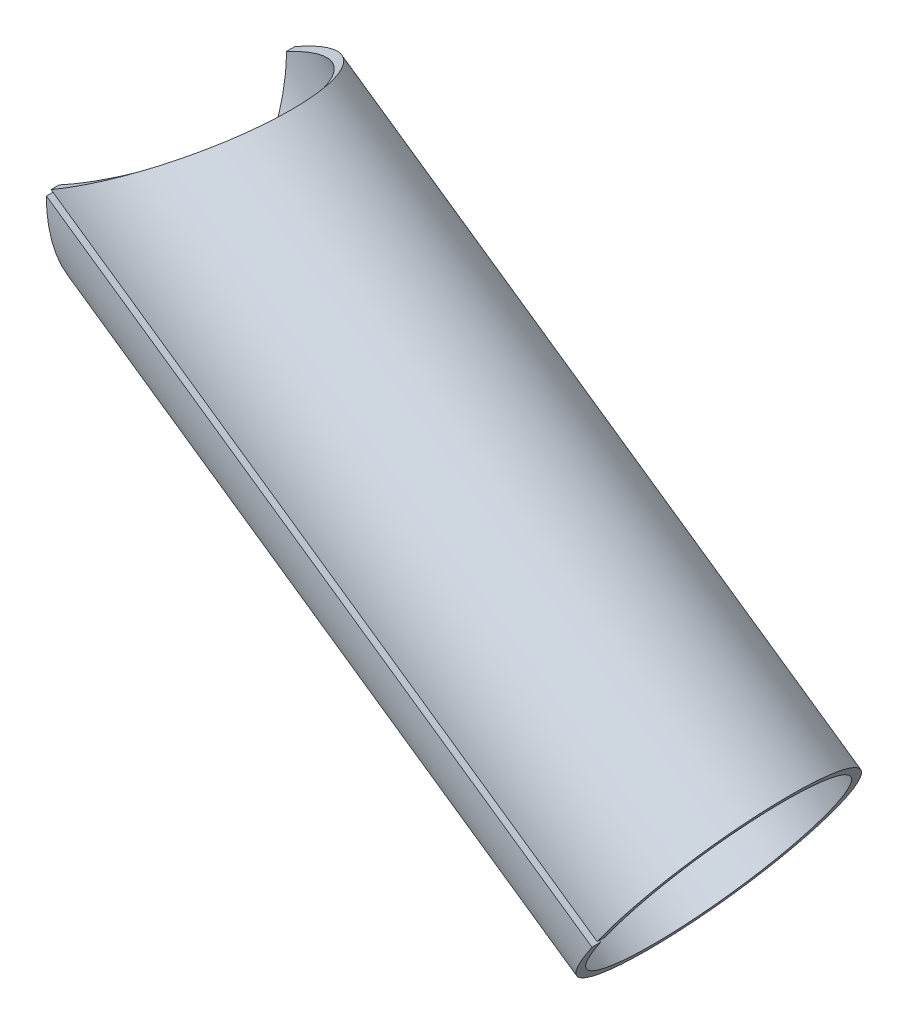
ISO-10303-21;
HEADER;
FILE_DESCRIPTION(('STEP AP214'),'2;1');
FILE_NAME('part.step','',(''),(''),'','','');
FILE_SCHEMA(('AUTOMOTIVE_DESIGN { 1 0 10303 214 1 1 1 1 }'));
ENDSEC;
DATA;
#1=APPLICATION_CONTEXT('core data for automotive mechanical design processes');
#2=APPLICATION_PROTOCOL_DEFINITION('international standard','automotive_design',2000,#1);
#3=PRODUCT_CONTEXT('',#1,'mechanical');
#4=PRODUCT('Part','Part','',(#3));
#5=PRODUCT_RELATED_PRODUCT_CATEGORY('part','',(#4));
#6=PRODUCT_DEFINITION_FORMATION('','',#4);
#7=PRODUCT_DEFINITION_CONTEXT('part definition',#1,'design');
#8=PRODUCT_DEFINITION('design','',#6,#7);
#9=PRODUCT_DEFINITION_SHAPE('','',#8);
#10=(LENGTH_UNIT() NAMED_UNIT(*) SI_UNIT(.MILLI.,.METRE.));
#11=(NAMED_UNIT(*) PLANE_ANGLE_UNIT() SI_UNIT($,.RADIAN.));
#12=(NAMED_UNIT(*) SI_UNIT($,.STERADIAN.) SOLID_ANGLE_UNIT());
#13=UNCERTAINTY_MEASURE_WITH_UNIT(LENGTH_MEASURE(1.E-05),#10,'distance_accuracy_value','');
#14=(GEOMETRIC_REPRESENTATION_CONTEXT(3) GLOBAL_UNCERTAINTY_ASSIGNED_CONTEXT((#13)) GLOBAL_UNIT_ASSIGNED_CONTEXT((#10,
#11,#12)) REPRESENTATION_CONTEXT('',''));
#15=CARTESIAN_POINT('',(0.,0.,0.));
#16=DIRECTION('',(0.,0.,1.));
#17=DIRECTION('',(1.,0.,0.));
#18=AXIS2_PLACEMENT_3D('',#15,#16,#17);
#19=CARTESIAN_POINT('',(1.01772680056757E-13,-5.70424794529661E-13,-14.6768756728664));
#20=CARTESIAN_POINT('',(-0.0275341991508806,-0.844175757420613,-14.6768756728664));
#21=CARTESIAN_POINT('',(-0.0512612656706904,-1.55701726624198,-14.6266268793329));
#22=CARTESIAN_POINT('',(-0.0794202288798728,-2.42781210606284,-14.5363171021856));
#23=CARTESIAN_POINT('',(-0.0876516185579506,-2.68506336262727,-14.5034964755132));
#24=CARTESIAN_POINT('',(-0.0985325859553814,-3.02180427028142,-14.4556541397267));
#25=CARTESIAN_POINT('',(-0.10186714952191,-3.12394525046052,-14.4402492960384));
#26=CARTESIAN_POINT('',(-0.108569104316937,-3.32916643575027,-14.4078018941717));
#27=CARTESIAN_POINT('',(-0.111888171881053,-3.43066408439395,-14.390952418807));
#28=CARTESIAN_POINT('',(-0.141445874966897,-4.33408784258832,-14.2340764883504));
#29=CARTESIAN_POINT('',(-0.165273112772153,-5.06531924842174,-14.057743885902));
#30=CARTESIAN_POINT('',(-0.192067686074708,-5.88969232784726,-13.8171874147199));
#31=CARTESIAN_POINT('',(-0.197275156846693,-6.04946349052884,-13.7682557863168));
#32=CARTESIAN_POINT('',(-0.20752951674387,-6.3634124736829,-13.6678598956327));
#33=CARTESIAN_POINT('',(-0.212582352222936,-6.51801382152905,-13.6162401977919));
#34=CARTESIAN_POINT('',(-0.227500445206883,-6.97467333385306,-13.4575035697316));
#35=CARTESIAN_POINT('',(-0.237122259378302,-7.26958259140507,-13.3465124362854));
#36=CARTESIAN_POINT('',(-0.255703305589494,-7.84031800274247,-13.1161883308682));
#37=CARTESIAN_POINT('',(-0.264662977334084,-8.11614479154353,-12.996855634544));
#38=CARTESIAN_POINT('',(-0.281996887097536,-8.64882668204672,-12.7517307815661));
#39=CARTESIAN_POINT('',(-0.290376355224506,-8.90488057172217,-12.6263523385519));
#40=CARTESIAN_POINT('',(-0.314837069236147,-9.65121212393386,-12.2399479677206));
#41=CARTESIAN_POINT('',(-0.330162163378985,-10.1213971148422,-11.9675716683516));
#42=CARTESIAN_POINT('',(-0.351734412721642,-10.7857038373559,-11.5431020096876));
#43=CARTESIAN_POINT('',(-0.358694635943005,-11.0003187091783,-11.3989559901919));
#44=CARTESIAN_POINT('',(-0.372222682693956,-11.4160061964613,-11.1063268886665));
#45=CARTESIAN_POINT('',(-0.378804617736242,-11.6166941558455,-10.9581368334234));
#46=CARTESIAN_POINT('',(-0.410789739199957,-12.5926214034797,-10.2041611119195));
#47=CARTESIAN_POINT('',(-0.433073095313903,-13.2842653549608,-9.55957362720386));
#48=CARTESIAN_POINT('',(-0.472652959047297,-14.4917009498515,-8.22670049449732));
#49=CARTESIAN_POINT('',(-0.489701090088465,-15.0158152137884,-7.52974022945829));
#50=CARTESIAN_POINT('',(-0.511422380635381,-15.6840309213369,-6.45840841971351));
#51=CARTESIAN_POINT('',(-0.518090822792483,-15.8869465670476,-6.09736129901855));
#52=CARTESIAN_POINT('',(-0.530184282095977,-16.2561978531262,-5.36546032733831));
#53=CARTESIAN_POINT('',(-0.535599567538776,-16.4222015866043,-4.99507351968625));
#54=CARTESIAN_POINT('',(-0.549957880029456,-16.8643568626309,-3.8747513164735));
#55=CARTESIAN_POINT('',(-0.557136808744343,-17.0843825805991,-3.11717862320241));
#56=CARTESIAN_POINT('',(-0.566820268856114,-17.3800346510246,-1.58564286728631));
#57=CARTESIAN_POINT('',(-0.569174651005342,-17.4550483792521,-0.81365694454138));
#58=CARTESIAN_POINT('',(-0.569384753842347,-17.4603094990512,0.729081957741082));
#59=CARTESIAN_POINT('',(-0.567124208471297,-17.3904622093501,1.50234719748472));
#60=CARTESIAN_POINT('',(-0.557789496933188,-17.1056928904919,3.03331018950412));
#61=CARTESIAN_POINT('',(-0.55089032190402,-16.8907688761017,3.79220960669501));
#62=CARTESIAN_POINT('',(-0.532015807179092,-16.3124884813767,5.28697577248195));
#63=CARTESIAN_POINT('',(-0.520125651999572,-15.9506839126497,6.01958239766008));
#64=CARTESIAN_POINT('',(-0.49870469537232,-15.2909081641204,7.09336297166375));
#65=CARTESIAN_POINT('',(-0.490916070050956,-15.0515744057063,7.44673534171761));
#66=CARTESIAN_POINT('',(-0.473986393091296,-14.5340092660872,8.14109006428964));
#67=CARTESIAN_POINT('',(-0.464850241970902,-14.2563866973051,8.48146930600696));
#68=CARTESIAN_POINT('',(-0.445386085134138,-13.6578310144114,9.15116360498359));
#69=CARTESIAN_POINT('',(-0.434998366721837,-13.3371495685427,9.4800675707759));
#70=CARTESIAN_POINT('',(-0.412689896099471,-12.6526592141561,10.121523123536));
#71=CARTESIAN_POINT('',(-0.400751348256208,-12.2899225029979,10.4332774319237));
#72=CARTESIAN_POINT('',(-0.375499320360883,-11.5163220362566,11.039482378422));
#73=CARTESIAN_POINT('',(-0.362161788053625,-11.1039150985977,11.334967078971));
#74=CARTESIAN_POINT('',(-0.340757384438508,-10.4464168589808,11.7615220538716));
#75=CARTESIAN_POINT('',(-0.333393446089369,-10.2207750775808,11.9009233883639));
#76=CARTESIAN_POINT('',(-0.318203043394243,-9.75653397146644,12.1732282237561));
#77=CARTESIAN_POINT('',(-0.310381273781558,-9.5186602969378,12.305771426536));
#78=CARTESIAN_POINT('',(-0.286241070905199,-8.77886556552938,12.6956351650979));
#79=CARTESIAN_POINT('',(-0.269151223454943,-8.25098907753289,12.9448968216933));
#80=CARTESIAN_POINT('',(-0.241624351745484,-7.40658023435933,13.2931079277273));
#81=CARTESIAN_POINT('',(-0.232141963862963,-7.1163573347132,13.4048864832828));
#82=CARTESIAN_POINT('',(-0.217495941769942,-6.66794751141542,13.5648056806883));
#83=CARTESIAN_POINT('',(-0.212542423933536,-6.51607197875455,13.6169159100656));
#84=CARTESIAN_POINT('',(-0.20239062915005,-6.20402541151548,13.7195376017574));
#85=CARTESIAN_POINT('',(-0.197201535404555,-6.04432483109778,13.7698799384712));
#86=CARTESIAN_POINT('',(-0.170632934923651,-5.22735290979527,14.0156031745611));
#87=CARTESIAN_POINT('',(-0.147236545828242,-4.5144615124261,14.1932074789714));
#88=CARTESIAN_POINT('',(-0.11889934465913,-3.646298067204,14.3534128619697));
#89=CARTESIAN_POINT('',(-0.115675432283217,-3.54703171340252,14.3710184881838));
#90=CARTESIAN_POINT('',(-0.108942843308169,-3.33888325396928,14.4062151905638));
#91=CARTESIAN_POINT('',(-0.105450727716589,-3.23061962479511,14.4236919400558));
#92=CARTESIAN_POINT('',(-0.0945623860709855,-2.8932106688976,14.4751750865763));
#93=CARTESIAN_POINT('',(-0.0867501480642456,-2.65144147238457,14.5082495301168));
#94=CARTESIAN_POINT('',(-0.0614947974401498,-1.87541514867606,14.5985252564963));
#95=CARTESIAN_POINT('',(-0.0421221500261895,-1.29035892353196,14.6470070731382));
#96=CARTESIAN_POINT('',(-0.0208117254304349,-0.63822155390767,14.6670646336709));
#97=CARTESIAN_POINT('',(1.1800771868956E-13,-5.48101616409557E-13,-13.6768756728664));
#98=CARTESIAN_POINT('',(-6.38221393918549E-06,-0.804410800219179,-13.6768756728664));
#99=CARTESIAN_POINT('',(-0.000477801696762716,-1.4836764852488,-13.6300505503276));
#100=CARTESIAN_POINT('',(-0.000246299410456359,-2.31347020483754,-13.5458939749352));
#101=CARTESIAN_POINT('',(-9.24727988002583E-05,-2.55861164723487,-13.5153095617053));
#102=CARTESIAN_POINT('',(5.11874892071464E-06,-2.87949747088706,-13.470726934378));
#103=CARTESIAN_POINT('',(1.34892863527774E-06,-2.97682816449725,-13.4563716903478));
#104=CARTESIAN_POINT('',(-8.34265898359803E-06,-3.17238447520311,-13.4261350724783));
#105=CARTESIAN_POINT('',(-1.74737781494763E-05,-3.26910195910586,-13.4104336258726));
#106=CARTESIAN_POINT('',(-0.000113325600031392,-4.12997731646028,-13.2642463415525));
#107=CARTESIAN_POINT('',(-9.62708077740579E-05,-4.82677312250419,-13.0999280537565));
#108=CARTESIAN_POINT('',(-1.08444860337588E-05,-5.61232647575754,-12.875761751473));
#109=CARTESIAN_POINT('',(-8.40286363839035E-06,-5.76457355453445,-12.8301640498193));
#110=CARTESIAN_POINT('',(-2.48492944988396E-05,-6.06373708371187,-12.7366085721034));
#111=CARTESIAN_POINT('',(-3.60465782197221E-05,-6.2110573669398,-12.6885059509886));
#112=CARTESIAN_POINT('',(-6.23647683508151E-05,-6.6462103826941,-12.5405847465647));
#113=CARTESIAN_POINT('',(-6.7388572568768E-05,-6.92723120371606,-12.43715592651));
#114=CARTESIAN_POINT('',(-3.80236607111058E-05,-7.47108971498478,-12.2225248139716));
#115=CARTESIAN_POINT('',(-4.04469043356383E-06,-7.73392799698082,-12.1113227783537));
#116=CARTESIAN_POINT('',(3.14338242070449E-05,-8.24152525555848,-11.8828993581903));
#117=CARTESIAN_POINT('',(2.26897446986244E-06,-8.48551975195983,-11.7660634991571));
#118=CARTESIAN_POINT('',(-0.000118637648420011,-9.19670008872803,-11.4059865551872));
#119=CARTESIAN_POINT('',(-0.000111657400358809,-9.64474270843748,-11.152168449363));
#120=CARTESIAN_POINT('',(-2.35609042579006E-05,-10.277767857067,-10.756619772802));
#121=CARTESIAN_POINT('',(1.37362198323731E-05,-10.4822770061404,-10.6222950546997));
#122=CARTESIAN_POINT('',(4.02179510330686E-05,-10.8783892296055,-10.3496040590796));
#123=CARTESIAN_POINT('',(3.33638032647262E-06,-11.069624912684,-10.2115108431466));
#124=CARTESIAN_POINT('',(-0.000154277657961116,-11.9995873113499,-9.50890679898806));
#125=CARTESIAN_POINT('',(0.000110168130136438,-12.6586680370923,-8.90823789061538));
#126=CARTESIAN_POINT('',(-9.19427207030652E-05,-13.8092348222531,-7.66617925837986));
#127=CARTESIAN_POINT('',(-5.02079284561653E-05,-14.3086681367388,-7.01670595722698));
#128=CARTESIAN_POINT('',(1.67915627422E-05,-14.9454174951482,-6.01836868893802));
#129=CARTESIAN_POINT('',(-3.36484999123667E-05,-15.1387755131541,-5.68192129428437));
#130=CARTESIAN_POINT('',(-8.50557173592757E-05,-15.4906358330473,-4.99988795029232));
#131=CARTESIAN_POINT('',(-8.70901992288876E-05,-15.6488218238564,-4.65473722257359));
#132=CARTESIAN_POINT('',(-2.85125033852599E-05,-16.0701564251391,-3.61074749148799));
#133=CARTESIAN_POINT('',(-3.25457237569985E-05,-16.2798202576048,-2.90479155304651));
#134=CARTESIAN_POINT('',(-7.41667852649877E-05,-16.5615477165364,-1.47760605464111));
#135=CARTESIAN_POINT('',(1.55432802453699E-05,-16.633031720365,-0.758218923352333));
#136=CARTESIAN_POINT('',(-2.21489706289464E-05,-16.6380438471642,0.679406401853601));
#137=CARTESIAN_POINT('',(-3.88717666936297E-05,-16.5714853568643,1.39998568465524));
#138=CARTESIAN_POINT('',(8.74038851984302E-06,-16.300128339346,2.82663744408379));
#139=CARTESIAN_POINT('',(-9.81151469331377E-05,-16.0953223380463,3.53382971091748));
#140=CARTESIAN_POINT('',(-8.10928195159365E-05,-15.5442756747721,4.92675089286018));
#141=CARTESIAN_POINT('',(8.96704353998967E-06,-15.1995126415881,5.60944181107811));
#142=CARTESIAN_POINT('',(-8.25937089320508E-05,-14.5708049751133,6.61006099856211));
#143=CARTESIAN_POINT('',(-9.80387181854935E-05,-14.3427417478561,6.93935655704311));
#144=CARTESIAN_POINT('',(-4.67676416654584E-05,-13.849552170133,7.58640184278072));
#145=CARTESIAN_POINT('',(3.45704933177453E-05,-13.5850064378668,7.9035895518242));
#146=CARTESIAN_POINT('',(-1.83415500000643E-05,-13.0146370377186,8.52765463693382));
#147=CARTESIAN_POINT('',(-8.61721173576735E-05,-12.7090553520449,8.83414893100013));
#148=CARTESIAN_POINT('',(-9.79375945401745E-05,-12.0567995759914,9.43189929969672));
#149=CARTESIAN_POINT('',(9.72138157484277E-06,-11.7111488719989,9.72241241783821));
#150=CARTESIAN_POINT('',(3.48932537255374E-05,-10.9739806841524,10.2873139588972));
#151=CARTESIAN_POINT('',(-7.32830711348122E-05,-10.580991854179,10.5626659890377));
#152=CARTESIAN_POINT('',(-0.000108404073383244,-9.95445628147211,10.9601579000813));
#153=CARTESIAN_POINT('',(-0.000102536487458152,-9.73944092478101,11.0900612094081));
#154=CARTESIAN_POINT('',(-5.16901211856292E-05,-9.29706415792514,11.3438127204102));
#155=CARTESIAN_POINT('',(1.1837776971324E-05,-9.07039482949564,11.4673251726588));
#156=CARTESIAN_POINT('',(2.77624665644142E-05,-8.36544004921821,11.8306257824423));
#157=CARTESIAN_POINT('',(-9.31502439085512E-05,-7.86241910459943,12.0629041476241));
#158=CARTESIAN_POINT('',(-0.000101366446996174,-7.05777605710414,12.387390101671));
#159=CARTESIAN_POINT('',(-8.32474712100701E-05,-6.78122132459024,12.4915526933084));
#160=CARTESIAN_POINT('',(-5.99190871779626E-05,-6.35392939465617,12.6405758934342));
#161=CARTESIAN_POINT('',(-5.89231734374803E-05,-6.20920622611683,12.6891356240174));
#162=CARTESIAN_POINT('',(-8.21111747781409E-05,-5.91185422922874,12.7847652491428));
#163=CARTESIAN_POINT('',(-0.000100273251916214,-5.75967389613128,12.8316775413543));
#164=CARTESIAN_POINT('',(-0.000170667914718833,-4.98117364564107,13.06065857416));
#165=CARTESIAN_POINT('',(-2.4215175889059E-05,-4.3018594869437,13.226161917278));
#166=CARTESIAN_POINT('',(2.49713007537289E-06,-3.47458166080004,13.3754518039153));
#167=CARTESIAN_POINT('',(-1.027228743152E-05,-3.37998967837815,13.391857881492));
#168=CARTESIAN_POINT('',(-6.39705061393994E-05,-3.18164188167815,13.424656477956));
#169=CARTESIAN_POINT('',(-0.000101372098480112,-3.07847553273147,13.4409424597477));
#170=CARTESIAN_POINT('',(-0.000213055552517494,-2.75695266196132,13.4889178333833));
#171=CARTESIAN_POINT('',(-0.000283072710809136,-2.52656691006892,13.5197387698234));
#172=CARTESIAN_POINT('',(-0.000332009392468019,-1.78708469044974,13.6038636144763));
#173=CARTESIAN_POINT('',(-4.39271316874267E-05,-1.22958673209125,13.6490422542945));
#174=CARTESIAN_POINT('',(6.41793476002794E-13,-0.608165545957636,13.6677331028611));
#175=B_SPLINE_SURFACE_WITH_KNOTS('',1,3,((#19,#20,#21,#22,#23,#24,#25,#26,#27,#28,#29,#30,#31,
#32,#33,#34,#35,#36,#37,#38,#39,#40,#41,#42,#43,#44,#45,#46,#47,#48,#49,#50,#51,#52,#53,#54,#55,
#56,#57,#58,#59,#60,#61,#62,#63,#64,#65,#66,#67,#68,#69,#70,#71,#72,#73,#74,#75,#76,#77,#78,#79,
#80,#81,#82,#83,#84,#85,#86,#87,#88,#89,#90,#91,#92,#93,#94,#95,#96),(#97,#98,#99,#100,#101,
#102,#103,#104,#105,#106,#107,#108,#109,#110,#111,#112,#113,#114,#115,#116,#117,#118,#119,#120,
#121,#122,#123,#124,#125,#126,#127,#128,#129,#130,#131,#132,#133,#134,#135,#136,#137,#138,#139,
#140,#141,#142,#143,#144,#145,#146,#147,#148,#149,#150,#151,#152,#153,#154,#155,#156,#157,#158,
#159,#160,#161,#162,#163,#164,#165,#166,#167,#168,#169,#170,#171,#172,#173,#174)),.UNSPECIFIED.,
.F.,.F.,.F.,(2,2),(4,2,2,2,2,2,2,2,2,2,2,2,2,2,2,2,2,2,2,2,2,2,2,2,2,2,2,2,2,2,2,2,2,2,2,2,2,2,
4),(0.,1.),(0.,0.015625,0.0234375,0.02734375,0.03125,0.0625,0.0703125,0.078125,0.09375,0.109375,
0.125,0.15625,0.171875,0.1875,0.25,0.3125,0.34375,0.375,0.4375,0.5,0.5625,0.625,0.6875,0.71875,
0.75,0.78125,0.8125,0.84375,0.859375,0.875,0.90625,0.921875,0.9296875,0.9375,0.96875,0.97265625,
0.9765625,0.984375,1.),.UNSPECIFIED.);
#176=CARTESIAN_POINT('',(-0.0208117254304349,-0.63822155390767,14.6670646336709));
#177=CARTESIAN_POINT('',(6.41793476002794E-13,-0.608165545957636,13.6677331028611));
#178=B_SPLINE_CURVE_WITH_KNOTS('',1,(#176,#177),.UNSPECIFIED.,.F.,.F.,(2,2),(0.,1.),.UNSPECIFIED.);
#179=CARTESIAN_POINT('',(6.41793476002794E-13,-0.608165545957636,13.6677331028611));
#180=VERTEX_POINT('',#179);
#181=CARTESIAN_POINT('',(-0.0208117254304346,-0.638221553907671,14.6670646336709));
#182=VERTEX_POINT('',#181);
#183=EDGE_CURVE('E13',#180,#182,#178,.F.);
#184=CARTESIAN_POINT('',(6.41793476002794E-13,-0.608165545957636,13.6677331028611));
#185=CARTESIAN_POINT('',(-4.39271316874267E-05,-1.22958673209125,13.6490422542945));
#186=CARTESIAN_POINT('',(-0.000332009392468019,-1.78708469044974,13.6038636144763));
#187=CARTESIAN_POINT('',(-0.000283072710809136,-2.52656691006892,13.5197387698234));
#188=CARTESIAN_POINT('',(-0.000213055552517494,-2.75695266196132,13.4889178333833));
#189=CARTESIAN_POINT('',(-0.000101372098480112,-3.07847553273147,13.4409424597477));
#190=CARTESIAN_POINT('',(-6.39705061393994E-05,-3.18164188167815,13.424656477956));
#191=CARTESIAN_POINT('',(-1.027228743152E-05,-3.37998967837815,13.391857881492));
#192=CARTESIAN_POINT('',(2.49713007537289E-06,-3.47458166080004,13.3754518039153));
#193=CARTESIAN_POINT('',(-2.4215175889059E-05,-4.3018594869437,13.226161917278));
#194=CARTESIAN_POINT('',(-0.000170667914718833,-4.98117364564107,13.06065857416));
#195=CARTESIAN_POINT('',(-0.000100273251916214,-5.75967389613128,12.8316775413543));
#196=CARTESIAN_POINT('',(-8.21111747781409E-05,-5.91185422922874,12.7847652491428));
#197=CARTESIAN_POINT('',(-5.89231734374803E-05,-6.20920622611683,12.6891356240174));
#198=CARTESIAN_POINT('',(-5.99190871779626E-05,-6.35392939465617,12.6405758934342));
#199=CARTESIAN_POINT('',(-8.32474712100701E-05,-6.78122132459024,12.4915526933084));
#200=CARTESIAN_POINT('',(-0.000101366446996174,-7.05777605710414,12.387390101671));
#201=CARTESIAN_POINT('',(-9.31502439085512E-05,-7.86241910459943,12.0629041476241));
#202=CARTESIAN_POINT('',(2.77624665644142E-05,-8.36544004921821,11.8306257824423));
#203=CARTESIAN_POINT('',(1.1837776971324E-05,-9.07039482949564,11.4673251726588));
#204=CARTESIAN_POINT('',(-5.16901211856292E-05,-9.29706415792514,11.3438127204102));
#205=CARTESIAN_POINT('',(-0.000102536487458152,-9.73944092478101,11.0900612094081));
#206=CARTESIAN_POINT('',(-0.000108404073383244,-9.95445628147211,10.9601579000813));
#207=CARTESIAN_POINT('',(-7.32830711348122E-05,-10.580991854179,10.5626659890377));
#208=CARTESIAN_POINT('',(3.48932537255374E-05,-10.9739806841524,10.2873139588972));
#209=CARTESIAN_POINT('',(9.72138157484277E-06,-11.7111488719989,9.72241241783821));
#210=CARTESIAN_POINT('',(-9.79375945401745E-05,-12.0567995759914,9.43189929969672));
#211=CARTESIAN_POINT('',(-8.61721173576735E-05,-12.7090553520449,8.83414893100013));
#212=CARTESIAN_POINT('',(-1.83415500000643E-05,-13.0146370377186,8.52765463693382));
#213=CARTESIAN_POINT('',(3.45704933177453E-05,-13.5850064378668,7.9035895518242));
#214=CARTESIAN_POINT('',(-4.67676416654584E-05,-13.849552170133,7.58640184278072));
#215=CARTESIAN_POINT('',(-9.80387181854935E-05,-14.3427417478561,6.93935655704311));
#216=CARTESIAN_POINT('',(-8.25937089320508E-05,-14.5708049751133,6.61006099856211));
#217=CARTESIAN_POINT('',(8.96704353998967E-06,-15.1995126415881,5.60944181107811));
#218=CARTESIAN_POINT('',(-8.10928195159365E-05,-15.5442756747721,4.92675089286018));
#219=CARTESIAN_POINT('',(-9.81151469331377E-05,-16.0953223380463,3.53382971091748));
#220=CARTESIAN_POINT('',(8.74038851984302E-06,-16.300128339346,2.82663744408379));
#221=CARTESIAN_POINT('',(-3.88717666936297E-05,-16.5714853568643,1.39998568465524));
#222=CARTESIAN_POINT('',(-2.21489706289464E-05,-16.6380438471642,0.679406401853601));
#223=CARTESIAN_POINT('',(1.55432802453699E-05,-16.633031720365,-0.758218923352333));
#224=CARTESIAN_POINT('',(-7.41667852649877E-05,-16.5615477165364,-1.47760605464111));
#225=CARTESIAN_POINT('',(-3.25457237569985E-05,-16.2798202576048,-2.90479155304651));
#226=CARTESIAN_POINT('',(-2.85125033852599E-05,-16.0701564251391,-3.61074749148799));
#227=CARTESIAN_POINT('',(-8.70901992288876E-05,-15.6488218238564,-4.65473722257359));
#228=CARTESIAN_POINT('',(-8.50557173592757E-05,-15.4906358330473,-4.99988795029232));
#229=CARTESIAN_POINT('',(-3.36484999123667E-05,-15.1387755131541,-5.68192129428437));
#230=CARTESIAN_POINT('',(1.67915627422E-05,-14.9454174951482,-6.01836868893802));
#231=CARTESIAN_POINT('',(-5.02079284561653E-05,-14.3086681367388,-7.01670595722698));
#232=CARTESIAN_POINT('',(-9.19427207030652E-05,-13.8092348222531,-7.66617925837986));
#233=CARTESIAN_POINT('',(0.000110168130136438,-12.6586680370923,-8.90823789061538));
#234=CARTESIAN_POINT('',(-0.000154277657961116,-11.9995873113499,-9.50890679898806));
#235=CARTESIAN_POINT('',(3.33638032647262E-06,-11.069624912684,-10.2115108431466));
#236=CARTESIAN_POINT('',(4.02179510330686E-05,-10.8783892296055,-10.3496040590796));
#237=CARTESIAN_POINT('',(1.37362198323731E-05,-10.4822770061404,-10.6222950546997));
#238=CARTESIAN_POINT('',(-2.35609042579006E-05,-10.277767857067,-10.756619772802));
#239=CARTESIAN_POINT('',(-0.000111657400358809,-9.64474270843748,-11.152168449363));
#240=CARTESIAN_POINT('',(-0.000118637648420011,-9.19670008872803,-11.4059865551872));
#241=CARTESIAN_POINT('',(2.26897446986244E-06,-8.48551975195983,-11.7660634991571));
#242=CARTESIAN_POINT('',(3.14338242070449E-05,-8.24152525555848,-11.8828993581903));
#243=CARTESIAN_POINT('',(-4.04469043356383E-06,-7.73392799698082,-12.1113227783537));
#244=CARTESIAN_POINT('',(-3.80236607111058E-05,-7.47108971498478,-12.2225248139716));
#245=CARTESIAN_POINT('',(-6.7388572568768E-05,-6.92723120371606,-12.43715592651));
#246=CARTESIAN_POINT('',(-6.23647683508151E-05,-6.6462103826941,-12.5405847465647));
#247=CARTESIAN_POINT('',(-3.60465782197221E-05,-6.2110573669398,-12.6885059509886));
#248=CARTESIAN_POINT('',(-2.48492944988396E-05,-6.06373708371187,-12.7366085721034));
#249=CARTESIAN_POINT('',(-8.40286363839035E-06,-5.76457355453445,-12.8301640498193));
#250=CARTESIAN_POINT('',(-1.08444860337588E-05,-5.61232647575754,-12.875761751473));
#251=CARTESIAN_POINT('',(-9.62708077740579E-05,-4.82677312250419,-13.0999280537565));
#252=CARTESIAN_POINT('',(-0.000113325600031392,-4.12997731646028,-13.2642463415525));
#253=CARTESIAN_POINT('',(-1.74737781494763E-05,-3.26910195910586,-13.4104336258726));
#254=CARTESIAN_POINT('',(-8.34265898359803E-06,-3.17238447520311,-13.4261350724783));
#255=CARTESIAN_POINT('',(1.34892863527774E-06,-2.97682816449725,-13.4563716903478));
#256=CARTESIAN_POINT('',(5.11874892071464E-06,-2.87949747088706,-13.470726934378));
#257=CARTESIAN_POINT('',(-9.24727988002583E-05,-2.55861164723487,-13.5153095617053));
#258=CARTESIAN_POINT('',(-0.000246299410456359,-2.31347020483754,-13.5458939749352));
#259=CARTESIAN_POINT('',(-0.000477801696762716,-1.4836764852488,-13.6300505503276));
#260=CARTESIAN_POINT('',(-6.38221393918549E-06,-0.804410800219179,-13.6768756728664));
#261=CARTESIAN_POINT('',(1.1800771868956E-13,-5.48101616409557E-13,-13.6768756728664));
#262=B_SPLINE_CURVE_WITH_KNOTS('',3,(#184,#185,#186,#187,#188,#189,#190,#191,#192,#193,#194,
#195,#196,#197,#198,#199,#200,#201,#202,#203,#204,#205,#206,#207,#208,#209,#210,#211,#212,#213,
#214,#215,#216,#217,#218,#219,#220,#221,#222,#223,#224,#225,#226,#227,#228,#229,#230,#231,#232,
#233,#234,#235,#236,#237,#238,#239,#240,#241,#242,#243,#244,#245,#246,#247,#248,#249,#250,#251,
#252,#253,#254,#255,#256,#257,#258,#259,#260,#261),.UNSPECIFIED.,.F.,.F.,(4,2,2,2,2,2,2,2,2,2,2,
2,2,2,2,2,2,2,2,2,2,2,2,2,2,2,2,2,2,2,2,2,2,2,2,2,2,2,4),(0.,0.015625,0.0234375,0.02734375,
0.03125,0.0625,0.0703125,0.078125,0.09375,0.125,0.140625,0.15625,0.1875,0.21875,0.25,0.28125,
0.3125,0.375,0.4375,0.5,0.5625,0.625,0.65625,0.6875,0.75,0.8125,0.828125,0.84375,0.875,0.890625,
0.90625,0.921875,0.9296875,0.9375,0.96875,0.97265625,0.9765625,0.984375,1.),.UNSPECIFIED.);
#263=CARTESIAN_POINT('',(1.54585620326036E-13,-5.4923832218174E-13,-13.6768756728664));
#264=VERTEX_POINT('',#263);
#265=EDGE_CURVE('E86',#264,#180,#262,.F.);
#266=CARTESIAN_POINT('',(1.1800771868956E-13,-5.48101616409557E-13,-13.6768756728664));
#267=CARTESIAN_POINT('',(1.01772680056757E-13,-5.70424794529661E-13,-14.6768756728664));
#268=B_SPLINE_CURVE_WITH_KNOTS('',1,(#266,#267),.UNSPECIFIED.,.F.,.F.,(2,2),(0.,1.),.UNSPECIFIED.);
#269=CARTESIAN_POINT('',(-1.7114838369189E-08,-5.24731077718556E-07,-14.6768756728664));
#270=VERTEX_POINT('',#269);
#271=EDGE_CURVE('E49',#264,#270,#268,.T.);
#272=CARTESIAN_POINT('',(1.01772680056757E-13,-5.70424794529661E-13,-14.6768756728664));
#273=CARTESIAN_POINT('',(-0.0275341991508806,-0.844175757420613,-14.6768756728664));
#274=CARTESIAN_POINT('',(-0.0512612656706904,-1.55701726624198,-14.6266268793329));
#275=CARTESIAN_POINT('',(-0.0794202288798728,-2.42781210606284,-14.5363171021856));
#276=CARTESIAN_POINT('',(-0.0876516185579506,-2.68506336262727,-14.5034964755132));
#277=CARTESIAN_POINT('',(-0.0985325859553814,-3.02180427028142,-14.4556541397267));
#278=CARTESIAN_POINT('',(-0.10186714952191,-3.12394525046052,-14.4402492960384));
#279=CARTESIAN_POINT('',(-0.108569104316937,-3.32916643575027,-14.4078018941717));
#280=CARTESIAN_POINT('',(-0.111888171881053,-3.43066408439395,-14.390952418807));
#281=CARTESIAN_POINT('',(-0.141445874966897,-4.33408784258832,-14.2340764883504));
#282=CARTESIAN_POINT('',(-0.165273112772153,-5.06531924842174,-14.057743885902));
#283=CARTESIAN_POINT('',(-0.192067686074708,-5.88969232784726,-13.8171874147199));
#284=CARTESIAN_POINT('',(-0.197275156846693,-6.04946349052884,-13.7682557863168));
#285=CARTESIAN_POINT('',(-0.20752951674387,-6.3634124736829,-13.6678598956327));
#286=CARTESIAN_POINT('',(-0.212582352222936,-6.51801382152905,-13.6162401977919));
#287=CARTESIAN_POINT('',(-0.227500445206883,-6.97467333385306,-13.4575035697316));
#288=CARTESIAN_POINT('',(-0.237122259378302,-7.26958259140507,-13.3465124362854));
#289=CARTESIAN_POINT('',(-0.255703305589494,-7.84031800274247,-13.1161883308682));
#290=CARTESIAN_POINT('',(-0.264662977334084,-8.11614479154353,-12.996855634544));
#291=CARTESIAN_POINT('',(-0.281996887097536,-8.64882668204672,-12.7517307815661));
#292=CARTESIAN_POINT('',(-0.290376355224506,-8.90488057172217,-12.6263523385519));
#293=CARTESIAN_POINT('',(-0.314837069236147,-9.65121212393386,-12.2399479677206));
#294=CARTESIAN_POINT('',(-0.330162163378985,-10.1213971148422,-11.9675716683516));
#295=CARTESIAN_POINT('',(-0.351734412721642,-10.7857038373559,-11.5431020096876));
#296=CARTESIAN_POINT('',(-0.358694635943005,-11.0003187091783,-11.3989559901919));
#297=CARTESIAN_POINT('',(-0.372222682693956,-11.4160061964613,-11.1063268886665));
#298=CARTESIAN_POINT('',(-0.378804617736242,-11.6166941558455,-10.9581368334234));
#299=CARTESIAN_POINT('',(-0.410789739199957,-12.5926214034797,-10.2041611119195));
#300=CARTESIAN_POINT('',(-0.433073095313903,-13.2842653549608,-9.55957362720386));
#301=CARTESIAN_POINT('',(-0.472652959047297,-14.4917009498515,-8.22670049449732));
#302=CARTESIAN_POINT('',(-0.489701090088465,-15.0158152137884,-7.52974022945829));
#303=CARTESIAN_POINT('',(-0.511422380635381,-15.6840309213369,-6.45840841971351));
#304=CARTESIAN_POINT('',(-0.518090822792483,-15.8869465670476,-6.09736129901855));
#305=CARTESIAN_POINT('',(-0.530184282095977,-16.2561978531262,-5.36546032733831));
#306=CARTESIAN_POINT('',(-0.535599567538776,-16.4222015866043,-4.99507351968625));
#307=CARTESIAN_POINT('',(-0.549957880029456,-16.8643568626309,-3.8747513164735));
#308=CARTESIAN_POINT('',(-0.557136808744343,-17.0843825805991,-3.11717862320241));
#309=CARTESIAN_POINT('',(-0.566820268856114,-17.3800346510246,-1.58564286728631));
#310=CARTESIAN_POINT('',(-0.569174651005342,-17.4550483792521,-0.81365694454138));
#311=CARTESIAN_POINT('',(-0.569384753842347,-17.4603094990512,0.729081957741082));
#312=CARTESIAN_POINT('',(-0.567124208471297,-17.3904622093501,1.50234719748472));
#313=CARTESIAN_POINT('',(-0.557789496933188,-17.1056928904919,3.03331018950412));
#314=CARTESIAN_POINT('',(-0.55089032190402,-16.8907688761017,3.79220960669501));
#315=CARTESIAN_POINT('',(-0.532015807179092,-16.3124884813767,5.28697577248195));
#316=CARTESIAN_POINT('',(-0.520125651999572,-15.9506839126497,6.01958239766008));
#317=CARTESIAN_POINT('',(-0.49870469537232,-15.2909081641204,7.09336297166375));
#318=CARTESIAN_POINT('',(-0.490916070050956,-15.0515744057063,7.44673534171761));
#319=CARTESIAN_POINT('',(-0.473986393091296,-14.5340092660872,8.14109006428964));
#320=CARTESIAN_POINT('',(-0.464850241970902,-14.2563866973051,8.48146930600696));
#321=CARTESIAN_POINT('',(-0.445386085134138,-13.6578310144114,9.15116360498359));
#322=CARTESIAN_POINT('',(-0.434998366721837,-13.3371495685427,9.4800675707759));
#323=CARTESIAN_POINT('',(-0.412689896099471,-12.6526592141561,10.121523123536));
#324=CARTESIAN_POINT('',(-0.400751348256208,-12.2899225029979,10.4332774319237));
#325=CARTESIAN_POINT('',(-0.375499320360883,-11.5163220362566,11.039482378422));
#326=CARTESIAN_POINT('',(-0.362161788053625,-11.1039150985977,11.334967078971));
#327=CARTESIAN_POINT('',(-0.340757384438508,-10.4464168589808,11.7615220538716));
#328=CARTESIAN_POINT('',(-0.333393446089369,-10.2207750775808,11.9009233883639));
#329=CARTESIAN_POINT('',(-0.318203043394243,-9.75653397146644,12.1732282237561));
#330=CARTESIAN_POINT('',(-0.310381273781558,-9.5186602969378,12.305771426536));
#331=CARTESIAN_POINT('',(-0.286241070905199,-8.77886556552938,12.6956351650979));
#332=CARTESIAN_POINT('',(-0.269151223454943,-8.25098907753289,12.9448968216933));
#333=CARTESIAN_POINT('',(-0.241624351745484,-7.40658023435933,13.2931079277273));
#334=CARTESIAN_POINT('',(-0.232141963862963,-7.1163573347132,13.4048864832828));
#335=CARTESIAN_POINT('',(-0.217495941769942,-6.66794751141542,13.5648056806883));
#336=CARTESIAN_POINT('',(-0.212542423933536,-6.51607197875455,13.6169159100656));
#337=CARTESIAN_POINT('',(-0.20239062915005,-6.20402541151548,13.7195376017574));
#338=CARTESIAN_POINT('',(-0.197201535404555,-6.04432483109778,13.7698799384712));
#339=CARTESIAN_POINT('',(-0.170632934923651,-5.22735290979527,14.0156031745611));
#340=CARTESIAN_POINT('',(-0.147236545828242,-4.5144615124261,14.1932074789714));
#341=CARTESIAN_POINT('',(-0.11889934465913,-3.646298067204,14.3534128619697));
#342=CARTESIAN_POINT('',(-0.115675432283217,-3.54703171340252,14.3710184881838));
#343=CARTESIAN_POINT('',(-0.108942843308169,-3.33888325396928,14.4062151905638));
#344=CARTESIAN_POINT('',(-0.105450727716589,-3.23061962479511,14.4236919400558));
#345=CARTESIAN_POINT('',(-0.0945623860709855,-2.8932106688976,14.4751750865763));
#346=CARTESIAN_POINT('',(-0.0867501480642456,-2.65144147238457,14.5082495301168));
#347=CARTESIAN_POINT('',(-0.0614947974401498,-1.87541514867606,14.5985252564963));
#348=CARTESIAN_POINT('',(-0.0421221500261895,-1.29035892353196,14.6470070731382));
#349=CARTESIAN_POINT('',(-0.0208117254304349,-0.63822155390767,14.6670646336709));
#350=B_SPLINE_CURVE_WITH_KNOTS('',3,(#272,#273,#274,#275,#276,#277,#278,#279,#280,#281,#282,
#283,#284,#285,#286,#287,#288,#289,#290,#291,#292,#293,#294,#295,#296,#297,#298,#299,#300,#301,
#302,#303,#304,#305,#306,#307,#308,#309,#310,#311,#312,#313,#314,#315,#316,#317,#318,#319,#320,
#321,#322,#323,#324,#325,#326,#327,#328,#329,#330,#331,#332,#333,#334,#335,#336,#337,#338,#339,
#340,#341,#342,#343,#344,#345,#346,#347,#348,#349),.UNSPECIFIED.,.F.,.F.,(4,2,2,2,2,2,2,2,2,2,2,
2,2,2,2,2,2,2,2,2,2,2,2,2,2,2,2,2,2,2,2,2,2,2,2,2,2,2,4),(0.,0.015625,0.0234375,0.02734375,
0.03125,0.0625,0.0703125,0.078125,0.09375,0.109375,0.125,0.15625,0.171875,0.1875,0.25,0.3125,
0.34375,0.375,0.4375,0.5,0.5625,0.625,0.6875,0.71875,0.75,0.78125,0.8125,0.84375,0.859375,0.875,
0.90625,0.921875,0.9296875,0.9375,0.96875,0.97265625,0.9765625,0.984375,1.),.UNSPECIFIED.);
#351=EDGE_CURVE('E89',#270,#182,#350,.T.);
#352=ORIENTED_EDGE('',*,*,#183,.F.);
#353=ORIENTED_EDGE('',*,*,#265,.F.);
#354=ORIENTED_EDGE('',*,*,#271,.T.);
#355=ORIENTED_EDGE('',*,*,#351,.T.);
#356=EDGE_LOOP('',(#352,#353,#354,#355));
#357=FACE_BOUND('',#356,.T.);
#358=ADVANCED_FACE('F38',(#357),#175,.F.);
#359=CARTESIAN_POINT('',(0.520811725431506,0.292005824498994,14.6670646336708));
#360=CARTESIAN_POINT('',(1.06241688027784,0.595714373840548,14.6466509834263));
#361=CARTESIAN_POINT('',(1.54904957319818,0.868860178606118,14.5967180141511));
#362=CARTESIAN_POINT('',(2.19590989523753,1.23150108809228,14.5031662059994));
#363=CARTESIAN_POINT('',(2.3976911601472,1.3445664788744,14.468816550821));
#364=CARTESIAN_POINT('',(2.67968270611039,1.5025547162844,14.4152118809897));
#365=CARTESIAN_POINT('',(2.77023422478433,1.55328402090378,14.3969931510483));
#366=CARTESIAN_POINT('',(2.90091057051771,1.62650317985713,14.3694384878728));
#367=CARTESIAN_POINT('',(2.94361090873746,1.65043049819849,14.3602155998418));
#368=CARTESIAN_POINT('',(3.006376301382,1.68560655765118,14.346359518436));
#369=CARTESIAN_POINT('',(3.02708391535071,1.69721276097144,14.3417371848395));
#370=CARTESIAN_POINT('',(3.05782439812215,1.71444382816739,14.3348024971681));
#371=CARTESIAN_POINT('',(3.06801773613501,1.72015781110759,14.3324907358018));
#372=CARTESIAN_POINT('',(3.08322755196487,1.72868428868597,14.3290233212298));
#373=CARTESIAN_POINT('',(3.08828412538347,1.73151903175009,14.3278675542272));
#374=CARTESIAN_POINT('',(3.09584894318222,1.73576003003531,14.3261340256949));
#375=CARTESIAN_POINT('',(3.09836720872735,1.73717184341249,14.3255562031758));
#376=CARTESIAN_POINT('',(3.10213959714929,1.73928678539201,14.3246895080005));
#377=CARTESIAN_POINT('',(3.10339622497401,1.73999130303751,14.3244006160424));
#378=CARTESIAN_POINT('',(3.10590781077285,1.74139941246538,14.3238228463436));
#379=CARTESIAN_POINT('',(3.10658976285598,1.74178174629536,14.3236659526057));
#380=CARTESIAN_POINT('',(3.5761619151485,2.00504917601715,14.2155064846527));
#381=CARTESIAN_POINT('',(4.01884467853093,2.25339267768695,14.0880089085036));
#382=CARTESIAN_POINT('',(4.64481120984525,2.60438819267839,13.8766722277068));
#383=CARTESIAN_POINT('',(4.84713322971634,2.71781371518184,13.8028689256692));
#384=CARTESIAN_POINT('',(5.14113333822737,2.88261753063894,13.6882305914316));
#385=CARTESIAN_POINT('',(5.23755335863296,2.93666373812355,13.6493615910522));
#386=CARTESIAN_POINT('',(5.3798194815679,3.01640928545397,13.5902056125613));
#387=CARTESIAN_POINT('',(5.42684756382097,3.0427705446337,13.5703448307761));
#388=CARTESIAN_POINT('',(5.49679973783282,3.0819829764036,13.540356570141));
#389=CARTESIAN_POINT('',(5.52001880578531,3.09499887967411,13.5303276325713));
#390=CARTESIAN_POINT('',(5.55470005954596,3.11444057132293,13.515236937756));
#391=CARTESIAN_POINT('',(5.56623591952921,3.12090744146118,13.5101988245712));
#392=CARTESIAN_POINT('',(5.58350289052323,3.13058723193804,13.5026300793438));
#393=CARTESIAN_POINT('',(5.58925241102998,3.13381040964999,13.5001052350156));
#394=CARTESIAN_POINT('',(5.59786748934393,3.13864005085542,13.4963151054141));
#395=CARTESIAN_POINT('',(5.60073764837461,3.14024907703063,13.4950512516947));
#396=CARTESIAN_POINT('',(5.60647489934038,3.14346542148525,13.4925225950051));
#397=CARTESIAN_POINT('',(5.60882355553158,3.14478209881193,13.4914867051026));
#398=CARTESIAN_POINT('',(6.04535882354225,3.38950871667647,13.2987364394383));
#399=CARTESIAN_POINT('',(6.45746623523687,3.6206306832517,13.0905347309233));
#400=CARTESIAN_POINT('',(7.04379197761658,3.94936298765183,12.7593826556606));
#401=CARTESIAN_POINT('',(7.23393397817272,4.05595728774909,12.6458521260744));
#402=CARTESIAN_POINT('',(7.51121278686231,4.21139667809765,12.471609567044));
#403=CARTESIAN_POINT('',(7.60231700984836,4.26246825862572,12.4128705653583));
#404=CARTESIAN_POINT('',(7.73699496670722,4.33797008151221,12.3238681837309));
#405=CARTESIAN_POINT('',(7.78155790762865,4.36295312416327,12.2940517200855));
#406=CARTESIAN_POINT('',(7.84790849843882,4.4001524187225,12.2491149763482));
#407=CARTESIAN_POINT('',(7.8699430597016,4.41250630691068,12.2341007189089));
#408=CARTESIAN_POINT('',(7.90287155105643,4.43096847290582,12.2115277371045));
#409=CARTESIAN_POINT('',(7.91382715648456,4.43711108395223,12.2039948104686));
#410=CARTESIAN_POINT('',(7.93022974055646,4.44630785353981,12.192682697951));
#411=CARTESIAN_POINT('',(7.93569213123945,4.44937058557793,12.1889098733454));
#412=CARTESIAN_POINT('',(7.9466066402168,4.45549033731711,12.1813600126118));
#413=CARTESIAN_POINT('',(7.95137484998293,4.45816388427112,12.1780574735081));
#414=CARTESIAN_POINT('',(8.34988281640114,4.68161035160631,11.9015718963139));
#415=CARTESIAN_POINT('',(8.72146262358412,4.88999230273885,11.6144731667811));
#416=CARTESIAN_POINT('',(9.24748334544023,5.1849038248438,11.1668814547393));
#417=CARTESIAN_POINT('',(9.41760326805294,5.28027061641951,11.0148567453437));
#418=CARTESIAN_POINT('',(9.66497137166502,5.41894223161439,10.7832133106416));
#419=CARTESIAN_POINT('',(9.74612569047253,5.46443669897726,10.7053975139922));
#420=CARTESIAN_POINT('',(9.86590907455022,5.53159076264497,10.587848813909));
#421=CARTESIAN_POINT('',(9.9055122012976,5.55379419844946,10.5485283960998));
#422=CARTESIAN_POINT('',(9.96443057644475,5.58682846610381,10.4893509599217));
#423=CARTESIAN_POINT('',(9.98398898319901,5.59779474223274,10.4695923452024));
#424=CARTESIAN_POINT('',(10.0132051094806,5.6141765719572,10.4399063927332));
#425=CARTESIAN_POINT('',(10.022923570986,5.61962591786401,10.4300030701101));
#426=CARTESIAN_POINT('',(10.0374709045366,5.62778305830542,10.4151362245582));
#427=CARTESIAN_POINT('',(10.0423149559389,5.63049929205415,10.4101786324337));
#428=CARTESIAN_POINT('',(10.0519929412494,5.63592613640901,10.4002595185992));
#429=CARTESIAN_POINT('',(10.056220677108,5.63829682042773,10.3959210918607));
#430=CARTESIAN_POINT('',(10.7573452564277,6.03145362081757,9.67525364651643));
#431=CARTESIAN_POINT('',(11.3651366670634,6.37285482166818,8.90168721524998));
#432=CARTESIAN_POINT('',(12.1428311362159,6.80879630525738,7.6898175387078));
#433=CARTESIAN_POINT('',(12.3797863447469,6.94149737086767,7.27724523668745));
#434=CARTESIAN_POINT('',(12.7019916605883,7.12189978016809,6.64965423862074));
#435=CARTESIAN_POINT('',(12.8038584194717,7.17892991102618,6.43899910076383));
#436=CARTESIAN_POINT('',(12.9484039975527,7.25988836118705,6.12132693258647));
#437=CARTESIAN_POINT('',(12.9952102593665,7.2861102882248,6.01515444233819));
#438=CARTESIAN_POINT('',(13.0633636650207,7.32430754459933,5.85553351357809));
#439=CARTESIAN_POINT('',(13.0857388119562,7.33685070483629,5.8022661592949));
#440=CARTESIAN_POINT('',(13.1132802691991,7.35229429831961,5.73561269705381));
#441=CARTESIAN_POINT('',(13.1185470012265,7.35524778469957,5.72281808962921));
#442=CARTESIAN_POINT('',(13.130550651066,7.36197962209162,5.69352115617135));
#443=CARTESIAN_POINT('',(13.1365285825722,7.36533230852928,5.67886424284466));
#444=CARTESIAN_POINT('',(13.1543906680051,7.37535062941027,5.63486841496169));
#445=CARTESIAN_POINT('',(13.1662031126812,7.38197652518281,5.60550441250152));
#446=CARTESIAN_POINT('',(13.5528561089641,7.598879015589,4.63541063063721));
#447=CARTESIAN_POINT('',(13.8295837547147,7.75451665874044,3.66118218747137));
#448=CARTESIAN_POINT('',(14.0957841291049,7.90365583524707,2.18232930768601));
#449=CARTESIAN_POINT('',(14.1597447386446,7.93937715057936,1.68645341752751));
#450=CARTESIAN_POINT('',(14.2186948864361,7.97221486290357,0.942231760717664));
#451=CARTESIAN_POINT('',(14.2321822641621,7.97970693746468,0.69408875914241));
#452=CARTESIAN_POINT('',(14.2432119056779,7.98582580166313,0.32225603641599));
#453=CARTESIAN_POINT('',(14.2453550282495,7.98701242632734,0.198375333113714));
#454=CARTESIAN_POINT('',(14.2462761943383,7.98752242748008,0.0127093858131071));
#455=CARTESIAN_POINT('',(14.246202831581,7.98748226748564,-0.0501758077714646));
#456=CARTESIAN_POINT('',(14.2454923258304,7.98708404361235,-0.144937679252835));
#457=CARTESIAN_POINT('',(14.245156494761,7.98689578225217,-0.176527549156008));
#458=CARTESIAN_POINT('',(14.2442867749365,7.98640812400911,-0.239711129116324));
#459=CARTESIAN_POINT('',(14.2437373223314,7.98609999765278,-0.272081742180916));
#460=CARTESIAN_POINT('',(14.2233636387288,7.97467277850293,-1.28907795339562));
#461=CARTESIAN_POINT('',(14.106134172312,7.90953112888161,-2.28129051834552));
#462=CARTESIAN_POINT('',(13.7821104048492,7.72788280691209,-3.7472289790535));
#463=CARTESIAN_POINT('',(13.6494437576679,7.65339874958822,-4.23212079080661));
#464=CARTESIAN_POINT('',(13.4135688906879,7.52093420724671,-4.94973677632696));
#465=CARTESIAN_POINT('',(13.3288007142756,7.47332669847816,-5.1873210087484));
#466=CARTESIAN_POINT('',(13.192471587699,7.39679127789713,-5.54074915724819));
#467=CARTESIAN_POINT('',(13.1454992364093,7.37042568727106,-5.65806714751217));
#468=CARTESIAN_POINT('',(13.0727530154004,7.32960568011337,-5.83324230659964));
#469=CARTESIAN_POINT('',(13.0481230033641,7.31578708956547,-5.89150038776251));
#470=CARTESIAN_POINT('',(13.0106069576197,7.29474259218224,-5.97867895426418));
#471=CARTESIAN_POINT('',(12.9980064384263,7.28767499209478,-6.00770371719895));
#472=CARTESIAN_POINT('',(12.9789630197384,7.27699460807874,-6.05118771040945));
#473=CARTESIAN_POINT('',(12.9725914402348,7.27342131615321,-6.06567351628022));
#474=CARTESIAN_POINT('',(12.9629984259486,7.26804165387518,-6.0873888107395));
#475=CARTESIAN_POINT('',(12.959794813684,7.26624514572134,-6.09462500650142));
#476=CARTESIAN_POINT('',(12.9533757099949,7.26264555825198,-6.10909290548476));
#477=CARTESIAN_POINT('',(12.9498456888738,7.26066611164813,-6.1170304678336));
#478=CARTESIAN_POINT('',(12.5748555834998,7.05039665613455,-6.95857322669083));
#479=CARTESIAN_POINT('',(12.1161599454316,6.79396261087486,-7.77918621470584));
#480=CARTESIAN_POINT('',(11.2957011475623,6.33401397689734,-8.95564834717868));
#481=CARTESIAN_POINT('',(11.0001884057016,6.16820990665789,-9.33867493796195));
#482=CARTESIAN_POINT('',(10.5240039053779,5.90095156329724,-9.89502099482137));
#483=CARTESIAN_POINT('',(10.3597931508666,5.80877818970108,-10.0774349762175));
#484=CARTESIAN_POINT('',(10.1053000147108,5.66595494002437,-10.3459221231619));
#485=CARTESIAN_POINT('',(10.0191063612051,5.61758698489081,-10.4345620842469));
#486=CARTESIAN_POINT('',(9.88777990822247,5.54390621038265,-10.5661647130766));
#487=CARTESIAN_POINT('',(9.84366510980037,5.5191578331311,-10.6098060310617));
#488=CARTESIAN_POINT('',(9.77698506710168,5.48175471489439,-10.6749194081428));
#489=CARTESIAN_POINT('',(9.75467374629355,5.46924025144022,-10.6965657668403));
#490=CARTESIAN_POINT('',(9.72107995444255,5.45039863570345,-10.7289469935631));
#491=CARTESIAN_POINT('',(9.70986088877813,5.44410644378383,-10.7397260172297));
#492=CARTESIAN_POINT('',(9.69300060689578,5.4346507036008,-10.7558723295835));
#493=CARTESIAN_POINT('',(9.6873752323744,5.43149588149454,-10.7612507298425));
#494=CARTESIAN_POINT('',(9.67611392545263,5.42518042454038,-10.7720000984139));
#495=CARTESIAN_POINT('',(9.66980085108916,5.42164005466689,-10.7780153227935));
#496=CARTESIAN_POINT('',(9.34713644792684,5.24069280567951,-11.0850092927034));
#497=CARTESIAN_POINT('',(9.00845619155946,5.05089022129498,-11.3795220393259));
#498=CARTESIAN_POINT('',(8.46864857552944,4.74826932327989,-11.8043725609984));
#499=CARTESIAN_POINT('',(8.28341875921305,4.64441519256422,-11.9431646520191));
#500=CARTESIAN_POINT('',(7.99763206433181,4.48416172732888,-12.1464133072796));
#501=CARTESIAN_POINT('',(7.9010464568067,4.42999894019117,-12.213339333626));
#502=CARTESIAN_POINT('',(7.75418552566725,4.34764098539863,-12.3124028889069));
#503=CARTESIAN_POINT('',(7.70490148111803,4.32000273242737,-12.3452031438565));
#504=CARTESIAN_POINT('',(7.63048030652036,4.27826766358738,-12.3940607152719));
#505=CARTESIAN_POINT('',(7.60559073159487,4.26430969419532,-12.410289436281));
#506=CARTESIAN_POINT('',(7.5681326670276,4.24330342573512,-12.4345453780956));
#507=CARTESIAN_POINT('',(7.55562602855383,4.2362897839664,-12.442616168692));
#508=CARTESIAN_POINT('',(7.53683515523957,4.2257520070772,-12.4547003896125));
#509=CARTESIAN_POINT('',(7.53056637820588,4.22223652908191,-12.4587248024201));
#510=CARTESIAN_POINT('',(7.51801852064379,4.21519980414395,-12.466766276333));
#511=CARTESIAN_POINT('',(7.51098353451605,4.21125465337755,-12.471266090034));
#512=CARTESIAN_POINT('',(7.15164235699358,4.00973994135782,-12.700756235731));
#513=CARTESIAN_POINT('',(6.77621980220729,3.79931235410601,-12.9183509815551));
#514=CARTESIAN_POINT('',(6.1803992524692,3.46525826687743,-13.2257462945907));
#515=CARTESIAN_POINT('',(5.97634960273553,3.3508453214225,-13.3250385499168));
#516=CARTESIAN_POINT('',(5.66212690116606,3.17465659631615,-13.4683544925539));
#517=CARTESIAN_POINT('',(5.55602833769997,3.1151660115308,-13.5151890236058));
#518=CARTESIAN_POINT('',(5.39484953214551,3.02479661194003,-13.5839235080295));
#519=CARTESIAN_POINT('',(5.34078479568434,2.99448459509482,-13.6065820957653));
#520=CARTESIAN_POINT('',(5.25918091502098,2.94873458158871,-13.640176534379));
#521=CARTESIAN_POINT('',(5.23189516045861,2.93343758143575,-13.6513091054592));
#522=CARTESIAN_POINT('',(5.19083996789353,2.9104217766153,-13.6679078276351));
#523=CARTESIAN_POINT('',(5.17713381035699,2.90273812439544,-13.6734240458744));
#524=CARTESIAN_POINT('',(5.15654295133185,2.89119509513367,-13.6816731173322));
#525=CARTESIAN_POINT('',(5.14967406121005,2.88734449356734,-13.6844185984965));
#526=CARTESIAN_POINT('',(5.13936282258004,2.88156420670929,-13.6885304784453));
#527=CARTESIAN_POINT('',(5.1359244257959,2.87963671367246,-13.6899000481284));
#528=CARTESIAN_POINT('',(5.12904499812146,2.87578026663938,-13.6926370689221));
#529=CARTESIAN_POINT('',(5.12502051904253,2.87352424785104,-13.6942361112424));
#530=CARTESIAN_POINT('',(4.75622247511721,2.66678634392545,-13.8406250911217));
#531=CARTESIAN_POINT('',(4.36284514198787,2.44634832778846,-13.978916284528));
#532=CARTESIAN_POINT('',(3.73125352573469,2.09220526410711,-14.1662842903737));
#533=CARTESIAN_POINT('',(3.51380936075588,1.97025379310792,-14.225381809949));
#534=CARTESIAN_POINT('',(3.17730452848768,1.78151691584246,-14.3076694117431));
#535=CARTESIAN_POINT('',(3.06341376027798,1.71763722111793,-14.3340380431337));
#536=CARTESIAN_POINT('',(2.89000371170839,1.62038078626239,-14.3718281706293));
#537=CARTESIAN_POINT('',(2.83177142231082,1.58772255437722,-14.384131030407));
#538=CARTESIAN_POINT('',(2.74378120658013,1.53837842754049,-14.4021226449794));
#539=CARTESIAN_POINT('',(2.71434417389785,1.52187092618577,-14.40804273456));
#540=CARTESIAN_POINT('',(2.67002841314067,1.49702081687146,-14.4168044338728));
#541=CARTESIAN_POINT('',(2.65522979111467,1.48872263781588,-14.4197052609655));
#542=CARTESIAN_POINT('',(2.63299183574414,1.47625319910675,-14.4240265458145));
#543=CARTESIAN_POINT('',(2.62557251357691,1.47209302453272,-14.4254619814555));
#544=CARTESIAN_POINT('',(2.61443352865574,1.46584722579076,-14.4276076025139));
#545=CARTESIAN_POINT('',(2.61071886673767,1.46376437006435,-14.4283215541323));
#546=CARTESIAN_POINT('',(2.60514437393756,1.46063870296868,-14.4293905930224));
#547=CARTESIAN_POINT('',(2.6032857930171,1.4595965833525,-14.4297466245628));
#548=CARTESIAN_POINT('',(2.5995677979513,1.45751188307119,-14.4304580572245));
#549=CARTESIAN_POINT('',(2.59695787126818,1.45604848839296,-14.4309567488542));
#550=CARTESIAN_POINT('',(2.31186309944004,1.29619522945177,-14.485388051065));
#551=CARTESIAN_POINT('',(1.95397067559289,1.09590208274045,-14.5450346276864));
#552=CARTESIAN_POINT('',(1.08875634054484,0.610858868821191,-14.6407874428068));
#553=CARTESIAN_POINT('',(0.581431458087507,0.325999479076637,-14.6768756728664));
#554=CARTESIAN_POINT('',(1.38350581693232E-13,-5.70546810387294E-13,-14.6768756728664));
#555=CARTESIAN_POINT('',(0.500000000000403,0.261949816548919,13.667733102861));
#556=CARTESIAN_POINT('',(1.0199588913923,0.534399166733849,13.6487104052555));
#557=CARTESIAN_POINT('',(1.48713820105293,0.779448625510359,13.6021795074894));
#558=CARTESIAN_POINT('',(2.1081510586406,1.10476098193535,13.5150017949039));
#559=CARTESIAN_POINT('',(2.30187128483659,1.20618473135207,13.4829925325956));
#560=CARTESIAN_POINT('',(2.57259813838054,1.34790465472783,13.43304018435));
#561=CARTESIAN_POINT('',(2.65953249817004,1.39341010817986,13.4160627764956));
#562=CARTESIAN_POINT('',(2.78498851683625,1.45909014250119,13.3903855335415));
#563=CARTESIAN_POINT('',(2.82598297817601,1.4805538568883,13.3817910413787));
#564=CARTESIAN_POINT('',(2.88624072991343,1.51210841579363,13.3688790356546));
#565=CARTESIAN_POINT('',(2.90612099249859,1.52251976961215,13.3645716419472));
#566=CARTESIAN_POINT('',(2.93563321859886,1.53797700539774,13.3581094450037));
#567=CARTESIAN_POINT('',(2.9454192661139,1.54310278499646,13.3559551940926));
#568=CARTESIAN_POINT('',(2.96002133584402,1.550751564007,13.3527240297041));
#569=CARTESIAN_POINT('',(2.96487585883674,1.55329450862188,13.3516470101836));
#570=CARTESIAN_POINT('',(2.97213839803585,1.5570989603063,13.3500315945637));
#571=CARTESIAN_POINT('',(2.9745560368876,1.55836544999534,13.3494931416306));
#572=CARTESIAN_POINT('',(2.9781776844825,1.56026269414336,13.3486854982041));
#573=CARTESIAN_POINT('',(2.97938409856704,1.56089469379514,13.348416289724));
#574=CARTESIAN_POINT('',(2.98179532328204,1.56215786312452,13.3478778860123));
#575=CARTESIAN_POINT('',(2.9824500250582,1.56250084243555,13.3477316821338));
#576=CARTESIAN_POINT('',(3.43325830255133,1.79866974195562,13.2469415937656));
#577=CARTESIAN_POINT('',(3.85824684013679,2.02145948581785,13.1281309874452));
#578=CARTESIAN_POINT('',(4.45919861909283,2.33632903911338,12.9311936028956));
#579=CARTESIAN_POINT('',(4.65343617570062,2.43807909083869,12.8624188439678));
#580=CARTESIAN_POINT('',(4.93568909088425,2.5859177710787,12.7555913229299));
#581=CARTESIAN_POINT('',(5.02825659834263,2.63440023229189,12.7193706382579));
#582=CARTESIAN_POINT('',(5.1648383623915,2.70593650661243,12.6642452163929));
#583=CARTESIAN_POINT('',(5.20998739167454,2.72958406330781,12.6457376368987));
#584=CARTESIAN_POINT('',(5.2771445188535,2.76475992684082,12.6177926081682));
#585=CARTESIAN_POINT('',(5.29943582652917,2.7764359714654,12.6084469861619));
#586=CARTESIAN_POINT('',(5.33273131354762,2.79387635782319,12.5943844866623));
#587=CARTESIAN_POINT('',(5.34380623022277,2.79967753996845,12.5896896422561));
#588=CARTESIAN_POINT('',(5.36038325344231,2.8083609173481,12.5826365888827));
#589=CARTESIAN_POINT('',(5.36590303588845,2.81125231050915,12.5802837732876));
#590=CARTESIAN_POINT('',(5.37417387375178,2.81558480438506,12.576751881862));
#591=CARTESIAN_POINT('',(5.37692934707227,2.81702820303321,12.5755741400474));
#592=CARTESIAN_POINT('',(5.38243734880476,2.81991346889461,12.5732177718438));
#593=CARTESIAN_POINT('',(5.38469215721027,2.8210946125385,12.57225246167));
#594=CARTESIAN_POINT('',(5.80378427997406,3.04063007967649,12.3926351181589));
#595=CARTESIAN_POINT('',(6.19942177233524,3.2479664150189,12.1986191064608));
#596=CARTESIAN_POINT('',(6.76231801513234,3.54286215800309,11.8900298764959));
#597=CARTESIAN_POINT('',(6.94486233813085,3.63848399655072,11.7842346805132));
#598=CARTESIAN_POINT('',(7.21106179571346,3.77792274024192,11.6218640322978));
#599=CARTESIAN_POINT('',(7.29852574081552,3.82373708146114,11.5671271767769));
#600=CARTESIAN_POINT('',(7.42782221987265,3.89146704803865,11.4841889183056));
#601=CARTESIAN_POINT('',(7.47060449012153,3.91387847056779,11.4564039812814));
#602=CARTESIAN_POINT('',(7.53430375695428,3.94724875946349,11.4145289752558));
#603=CARTESIAN_POINT('',(7.55545782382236,3.95833104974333,11.400537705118));
#604=CARTESIAN_POINT('',(7.58707048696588,3.97489291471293,11.3795027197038));
#605=CARTESIAN_POINT('',(7.5975883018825,3.98040327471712,11.372483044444));
#606=CARTESIAN_POINT('',(7.61333542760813,3.98865344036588,11.3619416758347));
#607=CARTESIAN_POINT('',(7.61857953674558,3.99140093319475,11.3584259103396));
#608=CARTESIAN_POINT('',(7.62905789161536,3.99689079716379,11.3513904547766));
#609=CARTESIAN_POINT('',(7.63363555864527,3.99928916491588,11.3483129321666));
#610=CARTESIAN_POINT('',(8.01621865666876,4.19973715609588,11.0906655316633));
#611=CARTESIAN_POINT('',(8.37294858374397,4.38667311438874,10.8231280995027));
#612=CARTESIAN_POINT('',(8.87794990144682,4.65122870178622,10.406032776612));
#613=CARTESIAN_POINT('',(9.04127228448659,4.73677858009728,10.2643661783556));
#614=CARTESIAN_POINT('',(9.27875619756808,4.86117558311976,10.0485056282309));
#615=CARTESIAN_POINT('',(9.35666778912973,4.90198694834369,9.97599176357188));
#616=CARTESIAN_POINT('',(9.47166478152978,4.96222857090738,9.86645217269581));
#617=CARTESIAN_POINT('',(9.50968539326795,4.98214656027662,9.82981082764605));
#618=CARTESIAN_POINT('',(9.5662493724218,5.01178064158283,9.77466541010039));
#619=CARTESIAN_POINT('',(9.58502620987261,5.02161818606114,9.75625303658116));
#620=CARTESIAN_POINT('',(9.61307481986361,5.03631390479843,9.72858971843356));
#621=CARTESIAN_POINT('',(9.62240491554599,5.04120237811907,9.71936115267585));
#622=CARTESIAN_POINT('',(9.63637090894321,5.04851995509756,9.70550725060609));
#623=CARTESIAN_POINT('',(9.64102138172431,5.05095662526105,9.70088744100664));
#624=CARTESIAN_POINT('',(9.65031261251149,5.05582492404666,9.69164415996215));
#625=CARTESIAN_POINT('',(9.6543713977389,5.0579516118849,9.68760132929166));
#626=CARTESIAN_POINT('',(10.3274771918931,5.41064406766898,9.01603612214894));
#627=CARTESIAN_POINT('',(10.9109611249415,5.71694074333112,8.29517616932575));
#628=CARTESIAN_POINT('',(11.6575817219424,6.10800576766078,7.16587649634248));
#629=CARTESIAN_POINT('',(11.8850730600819,6.22703924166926,6.78141455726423));
#630=CARTESIAN_POINT('',(12.1944109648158,6.38885871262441,6.19658409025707));
#631=CARTESIAN_POINT('',(12.2922097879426,6.44001398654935,6.00028181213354));
#632=CARTESIAN_POINT('',(12.4309819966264,6.512634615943,5.70425404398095));
#633=CARTESIAN_POINT('',(12.4759185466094,6.53615633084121,5.60531555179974));
#634=CARTESIAN_POINT('',(12.5413489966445,6.57042113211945,5.45657029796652));
#635=CARTESIAN_POINT('',(12.5628300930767,6.58167311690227,5.40693228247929));
#636=CARTESIAN_POINT('',(12.5892709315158,6.59552721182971,5.34482021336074));
#637=CARTESIAN_POINT('',(12.5943271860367,6.59817672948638,5.33289735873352));
#638=CARTESIAN_POINT('',(12.6058511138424,6.60421575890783,5.30559655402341));
#639=CARTESIAN_POINT('',(12.6115901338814,6.60722341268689,5.29193828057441));
#640=CARTESIAN_POINT('',(12.6287383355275,6.61621075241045,5.25094008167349));
#641=CARTESIAN_POINT('',(12.6400786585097,6.62215481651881,5.22357677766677));
#642=CARTESIAN_POINT('',(13.0112772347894,6.81673824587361,4.31957974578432));
#643=CARTESIAN_POINT('',(13.2769313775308,6.95638368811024,3.41172976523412));
#644=CARTESIAN_POINT('',(13.532497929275,7.09016564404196,2.03363762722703));
#645=CARTESIAN_POINT('',(13.5939071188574,7.12220223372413,1.5715479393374));
#646=CARTESIAN_POINT('',(13.6505084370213,7.151647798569,0.878033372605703));
#647=CARTESIAN_POINT('',(13.66345908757,7.15836473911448,0.646797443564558));
#648=CARTESIAN_POINT('',(13.6740500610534,7.16385008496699,0.300299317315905));
#649=CARTESIAN_POINT('',(13.6761080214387,7.16491371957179,0.184859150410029));
#650=CARTESIAN_POINT('',(13.6769925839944,7.16537085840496,0.0118434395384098));
#651=CARTESIAN_POINT('',(13.6769221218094,7.1653348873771,-0.0467571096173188));
#652=CARTESIAN_POINT('',(13.6762400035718,7.16497766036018,-0.135062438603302));
#653=CARTESIAN_POINT('',(13.6759175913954,7.16480877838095,-0.16449995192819));
#654=CARTESIAN_POINT('',(13.6750826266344,7.16437131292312,-0.223378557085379));
#655=CARTESIAN_POINT('',(13.6745551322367,7.16409489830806,-0.253543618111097));
#656=CARTESIAN_POINT('',(13.6549957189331,7.15384363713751,-1.2012474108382));
#657=CARTESIAN_POINT('',(13.542432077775,7.0954403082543,-2.12585617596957));
#658=CARTESIAN_POINT('',(13.2313556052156,6.93249029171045,-3.49191381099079));
#659=CARTESIAN_POINT('',(13.1039935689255,6.86566708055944,-3.94376781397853));
#660=CARTESIAN_POINT('',(12.877551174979,6.74682478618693,-4.61248947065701));
#661=CARTESIAN_POINT('',(12.7961729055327,6.7041129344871,-4.8338860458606));
#662=CARTESIAN_POINT('',(12.6652946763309,6.63544962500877,-5.16323358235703));
#663=CARTESIAN_POINT('',(12.6202002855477,6.61179615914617,-5.27255818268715));
#664=CARTESIAN_POINT('',(12.5503620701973,6.57517585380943,-5.43579788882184));
#665=CARTESIAN_POINT('',(12.5267165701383,6.56277908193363,-5.49008659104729));
#666=CARTESIAN_POINT('',(12.4906999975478,6.54390010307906,-5.57132529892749));
#667=CARTESIAN_POINT('',(12.4786030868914,6.537559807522,-5.59837247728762));
#668=CARTESIAN_POINT('',(12.4603207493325,6.52797856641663,-5.63889371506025));
#669=CARTESIAN_POINT('',(12.4542038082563,6.5247730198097,-5.65239253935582));
#670=CARTESIAN_POINT('',(12.444994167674,6.51994702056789,-5.67262827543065));
#671=CARTESIAN_POINT('',(12.4419185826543,6.51833540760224,-5.67937143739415));
#672=CARTESIAN_POINT('',(12.4357560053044,6.51510629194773,-5.69285357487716));
#673=CARTESIAN_POINT('',(12.4323670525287,6.51333057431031,-5.70025031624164));
#674=CARTESIAN_POINT('',(12.072362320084,6.32470278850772,-6.48445507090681));
#675=CARTESIAN_POINT('',(11.6319724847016,6.09470573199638,-7.24915609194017));
#676=CARTESIAN_POINT('',(10.8442973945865,5.68210287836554,-8.34546069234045));
#677=CARTESIAN_POINT('',(10.5605971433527,5.53335824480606,-8.7023899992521));
#678=CARTESIAN_POINT('',(10.1034497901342,5.29359308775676,-9.22082975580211));
#679=CARTESIAN_POINT('',(9.94580426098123,5.21090112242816,-9.39081507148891));
#680=CARTESIAN_POINT('',(9.70148503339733,5.08277089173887,-9.6410090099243));
#681=CARTESIAN_POINT('',(9.61873701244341,5.03937907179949,-9.7236095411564));
#682=CARTESIAN_POINT('',(9.4926599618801,4.97327941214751,-9.84624550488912));
#683=CARTESIAN_POINT('',(9.45030845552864,4.95107755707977,-9.88691334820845));
#684=CARTESIAN_POINT('',(9.38629351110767,4.91752333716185,-9.94759026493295));
#685=CARTESIAN_POINT('',(9.364873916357,4.90629669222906,-9.96776176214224));
#686=CARTESIAN_POINT('',(9.3326227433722,4.88939406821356,-9.99793671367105));
#687=CARTESIAN_POINT('',(9.32185205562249,4.88374941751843,-10.0079813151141));
#688=CARTESIAN_POINT('',(9.30566559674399,4.87526680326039,-10.0230275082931));
#689=CARTESIAN_POINT('',(9.30026503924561,4.87243665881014,-10.0280394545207));
#690=CARTESIAN_POINT('',(9.28945378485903,4.86677116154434,-10.0380564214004));
#691=CARTESIAN_POINT('',(9.28339300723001,4.86359515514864,-10.0436618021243));
#692=CARTESIAN_POINT('',(8.97362352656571,4.7012705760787,-10.3297389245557));
#693=CARTESIAN_POINT('',(8.64847422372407,4.53100920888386,-10.6041852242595));
#694=CARTESIAN_POINT('',(8.13023628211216,4.25953893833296,-11.0000888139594));
#695=CARTESIAN_POINT('',(7.95240829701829,4.16637443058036,-11.129424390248));
#696=CARTESIAN_POINT('',(7.67804233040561,4.0226146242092,-11.3188248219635));
#697=CARTESIAN_POINT('',(7.58531660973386,3.97402623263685,-11.3811908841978));
#698=CARTESIAN_POINT('',(7.44432480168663,3.9001443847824,-11.4735048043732));
#699=CARTESIAN_POINT('',(7.39701034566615,3.87535058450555,-11.5040702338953));
#700=CARTESIAN_POINT('',(7.32556334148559,3.83791077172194,-11.5495989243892));
#701=CARTESIAN_POINT('',(7.30166845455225,3.82538931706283,-11.5647219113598));
#702=CARTESIAN_POINT('',(7.26570736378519,3.80654495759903,-11.5873251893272));
#703=CARTESIAN_POINT('',(7.25370054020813,3.80025314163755,-11.5948460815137));
#704=CARTESIAN_POINT('',(7.23566062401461,3.79079988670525,-11.6061069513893));
#705=CARTESIAN_POINT('',(7.22964237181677,3.7876462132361,-11.6098571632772));
#706=CARTESIAN_POINT('',(7.21759597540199,3.78133369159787,-11.6173507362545));
#707=CARTESIAN_POINT('',(7.21084213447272,3.77779456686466,-11.621543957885));
#708=CARTESIAN_POINT('',(6.86586160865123,3.59701931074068,-11.8353979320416));
#709=CARTESIAN_POINT('',(6.50543901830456,3.40825446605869,-12.038166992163));
#710=CARTESIAN_POINT('',(5.93342732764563,3.10858480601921,-12.3246181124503));
#711=CARTESIAN_POINT('',(5.73753177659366,3.00594789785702,-12.4171451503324));
#712=CARTESIAN_POINT('',(5.43586585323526,2.84789349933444,-12.5506963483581));
#713=CARTESIAN_POINT('',(5.3340071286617,2.79452603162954,-12.5943398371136));
#714=CARTESIAN_POINT('',(5.17926907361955,2.71345827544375,-12.6583911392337));
#715=CARTESIAN_POINT('',(5.12736475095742,2.68626629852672,-12.6795058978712));
#716=CARTESIAN_POINT('',(5.04902167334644,2.64522549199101,-12.7108113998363));
#717=CARTESIAN_POINT('',(5.02282621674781,2.63150308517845,-12.7211854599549));
#718=CARTESIAN_POINT('',(4.98341150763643,2.61085644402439,-12.7366532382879));
#719=CARTESIAN_POINT('',(4.97025301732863,2.60396372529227,-12.7417936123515));
#720=CARTESIAN_POINT('',(4.95048491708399,2.59360891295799,-12.7494806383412));
#721=CARTESIAN_POINT('',(4.9438904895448,2.59015468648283,-12.7520390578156));
#722=CARTESIAN_POINT('',(4.93399125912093,2.58496941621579,-12.7558707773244));
#723=CARTESIAN_POINT('',(4.93069025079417,2.58324033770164,-12.7571470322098));
#724=CARTESIAN_POINT('',(4.92408570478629,2.57978087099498,-12.7596975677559));
#725=CARTESIAN_POINT('',(4.92022203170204,2.57775708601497,-12.7611876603));
#726=CARTESIAN_POINT('',(4.5661600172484,2.39230075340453,-12.897602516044));
#727=CARTESIAN_POINT('',(4.18849832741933,2.19455905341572,-13.0264713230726));
#728=CARTESIAN_POINT('',(3.58214604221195,1.87686628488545,-13.2010731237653));
#729=CARTESIAN_POINT('',(3.37339213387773,1.76746516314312,-13.2561440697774));
#730=CARTESIAN_POINT('',(3.05033623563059,1.5981510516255,-13.3328250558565));
#731=CARTESIAN_POINT('',(2.94099732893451,1.54084509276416,-13.3573970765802));
#732=CARTESIAN_POINT('',(2.77451772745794,1.45359751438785,-13.3926123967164));
#733=CARTESIAN_POINT('',(2.71861269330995,1.42430027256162,-13.4040770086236));
#734=CARTESIAN_POINT('',(2.63413890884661,1.38003452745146,-13.4208427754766));
#735=CARTESIAN_POINT('',(2.60587827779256,1.36522596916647,-13.4263595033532));
#736=CARTESIAN_POINT('',(2.56333349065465,1.34293347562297,-13.4345242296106));
#737=CARTESIAN_POINT('',(2.54912625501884,1.33548936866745,-13.4372274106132));
#738=CARTESIAN_POINT('',(2.52777696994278,1.3243033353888,-13.4412542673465));
#739=CARTESIAN_POINT('',(2.52065413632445,1.32057134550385,-13.4425919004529));
#740=CARTESIAN_POINT('',(2.50996028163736,1.31496839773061,-13.4445913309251));
#741=CARTESIAN_POINT('',(2.50639406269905,1.31309992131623,-13.445256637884));
#742=CARTESIAN_POINT('',(2.50104233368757,1.3102959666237,-13.4462528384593));
#743=CARTESIAN_POINT('',(2.49925802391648,1.30936110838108,-13.4465846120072));
#744=CARTESIAN_POINT('',(2.49568860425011,1.30749097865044,-13.4472475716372));
#745=CARTESIAN_POINT('',(2.49318297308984,1.30617820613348,-13.4477122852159));
#746=CARTESIAN_POINT('',(2.21948088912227,1.16277811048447,-13.4984349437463));
#747=CARTESIAN_POINT('',(1.87587817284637,0.983121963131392,-13.5540175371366));
#748=CARTESIAN_POINT('',(1.04523602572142,0.548007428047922,-13.6432462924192));
#749=CARTESIAN_POINT('',(0.558193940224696,0.292443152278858,-13.6768756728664));
#750=CARTESIAN_POINT('',(1.54585620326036E-13,-5.4923832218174E-13,-13.6768756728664));
#751=B_SPLINE_SURFACE_WITH_KNOTS('',1,3,((#359,#360,#361,#362,#363,#364,#365,#366,#367,#368,
#369,#370,#371,#372,#373,#374,#375,#376,#377,#378,#379,#380,#381,#382,#383,#384,#385,#386,#387,
#388,#389,#390,#391,#392,#393,#394,#395,#396,#397,#398,#399,#400,#401,#402,#403,#404,#405,#406,
#407,#408,#409,#410,#411,#412,#413,#414,#415,#416,#417,#418,#419,#420,#421,#422,#423,#424,#425,
#426,#427,#428,#429,#430,#431,#432,#433,#434,#435,#436,#437,#438,#439,#440,#441,#442,#443,#444,
#445,#446,#447,#448,#449,#450,#451,#452,#453,#454,#455,#456,#457,#458,#459,#460,#461,#462,#463,
#464,#465,#466,#467,#468,#469,#470,#471,#472,#473,#474,#475,#476,#477,#478,#479,#480,#481,#482,
#483,#484,#485,#486,#487,#488,#489,#490,#491,#492,#493,#494,#495,#496,#497,#498,#499,#500,#501,
#502,#503,#504,#505,#506,#507,#508,#509,#510,#511,#512,#513,#514,#515,#516,#517,#518,#519,#520,
#521,#522,#523,#524,#525,#526,#527,#528,#529,#530,#531,#532,#533,#534,#535,#536,#537,#538,#539,
#540,#541,#542,#543,#544,#545,#546,#547,#548,#549,#550,#551,#552,#553,#554),(#555,#556,#557,
#558,#559,#560,#561,#562,#563,#564,#565,#566,#567,#568,#569,#570,#571,#572,#573,#574,#575,#576,
#577,#578,#579,#580,#581,#582,#583,#584,#585,#586,#587,#588,#589,#590,#591,#592,#593,#594,#595,
#596,#597,#598,#599,#600,#601,#602,#603,#604,#605,#606,#607,#608,#609,#610,#611,#612,#613,#614,
#615,#616,#617,#618,#619,#620,#621,#622,#623,#624,#625,#626,#627,#628,#629,#630,#631,#632,#633,
#634,#635,#636,#637,#638,#639,#640,#641,#642,#643,#644,#645,#646,#647,#648,#649,#650,#651,#652,
#653,#654,#655,#656,#657,#658,#659,#660,#661,#662,#663,#664,#665,#666,#667,#668,#669,#670,#671,
#672,#673,#674,#675,#676,#677,#678,#679,#680,#681,#682,#683,#684,#685,#686,#687,#688,#689,#690,
#691,#692,#693,#694,#695,#696,#697,#698,#699,#700,#701,#702,#703,#704,#705,#706,#707,#708,#709,
#710,#711,#712,#713,#714,#715,#716,#717,#718,#719,#720,#721,#722,#723,#724,#725,#726,#727,#728,
#729,#730,#731,#732,#733,#734,#735,#736,#737,#738,#739,#740,#741,#742,#743,#744,#745,#746,#747,
#748,#749,#750)),.UNSPECIFIED.,.F.,.F.,.F.,(2,2),(4,2,2,2,2,2,2,2,2,2,2,2,2,2,2,2,2,2,2,2,2,2,2,
2,2,2,2,2,2,2,2,2,2,2,2,2,2,2,2,2,2,2,2,2,2,2,2,2,2,2,2,2,2,2,2,2,2,2,2,2,2,2,2,2,2,2,2,2,2,2,2,
2,2,2,2,2,2,2,2,2,2,2,2,2,2,2,2,2,2,2,2,2,2,2,2,2,2,4),(0.,1.),(0.,0.03125,0.046875,0.0546875,
0.05859375,0.060546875,0.0615234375,0.06201171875,0.062255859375,0.0623779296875,0.0625,0.09375,
0.109375,0.1171875,0.12109375,0.123046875,0.1240234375,0.12451171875,0.124755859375,0.125,
0.15625,0.171875,0.1796875,0.18359375,0.185546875,0.1865234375,0.18701171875,0.1875,0.21875,
0.234375,0.2421875,0.24609375,0.248046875,0.2490234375,0.24951171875,0.25,0.3125,0.34375,
0.359375,0.3671875,0.37109375,0.3720703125,0.373046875,0.375,0.4375,0.46875,0.484375,0.4921875,
0.49609375,0.498046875,0.5,0.5625,0.59375,0.609375,0.6171875,0.62109375,0.623046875,
0.6240234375,0.62451171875,0.625,0.6875,0.71875,0.734375,0.7421875,0.74609375,0.748046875,
0.7490234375,0.74951171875,0.75,0.78125,0.796875,0.8046875,0.80859375,0.810546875,0.8115234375,
0.81201171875,0.8125,0.84375,0.859375,0.8671875,0.87109375,0.873046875,0.8740234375,
0.87451171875,0.874755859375,0.875,0.90625,0.921875,0.9296875,0.93359375,0.935546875,
0.9365234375,0.93701171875,0.937255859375,0.9373779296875,0.9375,0.96875,1.),.UNSPECIFIED.);
#752=CARTESIAN_POINT('',(1.54585620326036E-13,-5.4923832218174E-13,-13.6768756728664));
#753=CARTESIAN_POINT('',(0.558193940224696,0.292443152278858,-13.6768756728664));
#754=CARTESIAN_POINT('',(1.04523602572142,0.548007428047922,-13.6432462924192));
#755=CARTESIAN_POINT('',(1.87587817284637,0.983121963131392,-13.5540175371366));
#756=CARTESIAN_POINT('',(2.21948088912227,1.16277811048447,-13.4984349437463));
#757=CARTESIAN_POINT('',(2.49318297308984,1.30617820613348,-13.4477122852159));
#758=CARTESIAN_POINT('',(2.49568860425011,1.30749097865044,-13.4472475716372));
#759=CARTESIAN_POINT('',(2.49925802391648,1.30936110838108,-13.4465846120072));
#760=CARTESIAN_POINT('',(2.50104233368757,1.3102959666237,-13.4462528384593));
#761=CARTESIAN_POINT('',(2.50639406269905,1.31309992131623,-13.445256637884));
#762=CARTESIAN_POINT('',(2.50996028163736,1.31496839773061,-13.4445913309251));
#763=CARTESIAN_POINT('',(2.52065413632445,1.32057134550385,-13.4425919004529));
#764=CARTESIAN_POINT('',(2.52777696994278,1.3243033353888,-13.4412542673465));
#765=CARTESIAN_POINT('',(2.54912625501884,1.33548936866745,-13.4372274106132));
#766=CARTESIAN_POINT('',(2.56333349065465,1.34293347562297,-13.4345242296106));
#767=CARTESIAN_POINT('',(2.60587827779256,1.36522596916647,-13.4263595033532));
#768=CARTESIAN_POINT('',(2.63413890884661,1.38003452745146,-13.4208427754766));
#769=CARTESIAN_POINT('',(2.71861269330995,1.42430027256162,-13.4040770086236));
#770=CARTESIAN_POINT('',(2.77451772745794,1.45359751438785,-13.3926123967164));
#771=CARTESIAN_POINT('',(2.94099732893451,1.54084509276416,-13.3573970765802));
#772=CARTESIAN_POINT('',(3.05033623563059,1.5981510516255,-13.3328250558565));
#773=CARTESIAN_POINT('',(3.37339213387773,1.76746516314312,-13.2561440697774));
#774=CARTESIAN_POINT('',(3.58214604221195,1.87686628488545,-13.2010731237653));
#775=CARTESIAN_POINT('',(4.18849832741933,2.19455905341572,-13.0264713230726));
#776=CARTESIAN_POINT('',(4.5661600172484,2.39230075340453,-12.897602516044));
#777=CARTESIAN_POINT('',(4.92022203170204,2.57775708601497,-12.7611876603));
#778=CARTESIAN_POINT('',(4.92408570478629,2.57978087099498,-12.7596975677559));
#779=CARTESIAN_POINT('',(4.93069025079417,2.58324033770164,-12.7571470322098));
#780=CARTESIAN_POINT('',(4.93399125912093,2.58496941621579,-12.7558707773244));
#781=CARTESIAN_POINT('',(4.9438904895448,2.59015468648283,-12.7520390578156));
#782=CARTESIAN_POINT('',(4.95048491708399,2.59360891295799,-12.7494806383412));
#783=CARTESIAN_POINT('',(4.97025301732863,2.60396372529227,-12.7417936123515));
#784=CARTESIAN_POINT('',(4.98341150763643,2.61085644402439,-12.7366532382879));
#785=CARTESIAN_POINT('',(5.02282621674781,2.63150308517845,-12.7211854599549));
#786=CARTESIAN_POINT('',(5.04902167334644,2.64522549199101,-12.7108113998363));
#787=CARTESIAN_POINT('',(5.12736475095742,2.68626629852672,-12.6795058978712));
#788=CARTESIAN_POINT('',(5.17926907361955,2.71345827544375,-12.6583911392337));
#789=CARTESIAN_POINT('',(5.3340071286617,2.79452603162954,-12.5943398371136));
#790=CARTESIAN_POINT('',(5.43586585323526,2.84789349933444,-12.5506963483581));
#791=CARTESIAN_POINT('',(5.73753177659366,3.00594789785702,-12.4171451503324));
#792=CARTESIAN_POINT('',(5.93342732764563,3.10858480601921,-12.3246181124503));
#793=CARTESIAN_POINT('',(6.50543901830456,3.40825446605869,-12.038166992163));
#794=CARTESIAN_POINT('',(6.86586160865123,3.59701931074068,-11.8353979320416));
#795=CARTESIAN_POINT('',(7.21084213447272,3.77779456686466,-11.621543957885));
#796=CARTESIAN_POINT('',(7.21759597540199,3.78133369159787,-11.6173507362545));
#797=CARTESIAN_POINT('',(7.22964237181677,3.7876462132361,-11.6098571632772));
#798=CARTESIAN_POINT('',(7.23566062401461,3.79079988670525,-11.6061069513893));
#799=CARTESIAN_POINT('',(7.25370054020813,3.80025314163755,-11.5948460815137));
#800=CARTESIAN_POINT('',(7.26570736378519,3.80654495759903,-11.5873251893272));
#801=CARTESIAN_POINT('',(7.30166845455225,3.82538931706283,-11.5647219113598));
#802=CARTESIAN_POINT('',(7.32556334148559,3.83791077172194,-11.5495989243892));
#803=CARTESIAN_POINT('',(7.39701034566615,3.87535058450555,-11.5040702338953));
#804=CARTESIAN_POINT('',(7.44432480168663,3.9001443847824,-11.4735048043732));
#805=CARTESIAN_POINT('',(7.58531660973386,3.97402623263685,-11.3811908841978));
#806=CARTESIAN_POINT('',(7.67804233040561,4.0226146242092,-11.3188248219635));
#807=CARTESIAN_POINT('',(7.95240829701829,4.16637443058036,-11.129424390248));
#808=CARTESIAN_POINT('',(8.13023628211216,4.25953893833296,-11.0000888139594));
#809=CARTESIAN_POINT('',(8.64847422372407,4.53100920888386,-10.6041852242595));
#810=CARTESIAN_POINT('',(8.97362352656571,4.7012705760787,-10.3297389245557));
#811=CARTESIAN_POINT('',(9.28339300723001,4.86359515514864,-10.0436618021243));
#812=CARTESIAN_POINT('',(9.28945378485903,4.86677116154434,-10.0380564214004));
#813=CARTESIAN_POINT('',(9.30026503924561,4.87243665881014,-10.0280394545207));
#814=CARTESIAN_POINT('',(9.30566559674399,4.87526680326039,-10.0230275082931));
#815=CARTESIAN_POINT('',(9.32185205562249,4.88374941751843,-10.0079813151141));
#816=CARTESIAN_POINT('',(9.3326227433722,4.88939406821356,-9.99793671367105));
#817=CARTESIAN_POINT('',(9.364873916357,4.90629669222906,-9.96776176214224));
#818=CARTESIAN_POINT('',(9.38629351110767,4.91752333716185,-9.94759026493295));
#819=CARTESIAN_POINT('',(9.45030845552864,4.95107755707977,-9.88691334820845));
#820=CARTESIAN_POINT('',(9.4926599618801,4.97327941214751,-9.84624550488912));
#821=CARTESIAN_POINT('',(9.61873701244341,5.03937907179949,-9.7236095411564));
#822=CARTESIAN_POINT('',(9.70148503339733,5.08277089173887,-9.6410090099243));
#823=CARTESIAN_POINT('',(9.94580426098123,5.21090112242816,-9.39081507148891));
#824=CARTESIAN_POINT('',(10.1034497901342,5.29359308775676,-9.22082975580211));
#825=CARTESIAN_POINT('',(10.5605971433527,5.53335824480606,-8.7023899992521));
#826=CARTESIAN_POINT('',(10.8442973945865,5.68210287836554,-8.34546069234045));
#827=CARTESIAN_POINT('',(11.6319724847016,6.09470573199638,-7.24915609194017));
#828=CARTESIAN_POINT('',(12.072362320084,6.32470278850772,-6.48445507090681));
#829=CARTESIAN_POINT('',(12.4323670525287,6.51333057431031,-5.70025031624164));
#830=CARTESIAN_POINT('',(12.4357560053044,6.51510629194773,-5.69285357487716));
#831=CARTESIAN_POINT('',(12.4419185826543,6.51833540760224,-5.67937143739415));
#832=CARTESIAN_POINT('',(12.444994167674,6.51994702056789,-5.67262827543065));
#833=CARTESIAN_POINT('',(12.4542038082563,6.5247730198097,-5.65239253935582));
#834=CARTESIAN_POINT('',(12.4603207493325,6.52797856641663,-5.63889371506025));
#835=CARTESIAN_POINT('',(12.4786030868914,6.537559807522,-5.59837247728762));
#836=CARTESIAN_POINT('',(12.4906999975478,6.54390010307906,-5.57132529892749));
#837=CARTESIAN_POINT('',(12.5267165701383,6.56277908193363,-5.49008659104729));
#838=CARTESIAN_POINT('',(12.5503620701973,6.57517585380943,-5.43579788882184));
#839=CARTESIAN_POINT('',(12.6202002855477,6.61179615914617,-5.27255818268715));
#840=CARTESIAN_POINT('',(12.6652946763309,6.63544962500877,-5.16323358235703));
#841=CARTESIAN_POINT('',(12.7961729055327,6.7041129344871,-4.8338860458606));
#842=CARTESIAN_POINT('',(12.877551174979,6.74682478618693,-4.61248947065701));
#843=CARTESIAN_POINT('',(13.1039935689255,6.86566708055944,-3.94376781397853));
#844=CARTESIAN_POINT('',(13.2313556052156,6.93249029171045,-3.49191381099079));
#845=CARTESIAN_POINT('',(13.542432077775,7.0954403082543,-2.12585617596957));
#846=CARTESIAN_POINT('',(13.6549957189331,7.15384363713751,-1.2012474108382));
#847=CARTESIAN_POINT('',(13.6745551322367,7.16409489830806,-0.253543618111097));
#848=CARTESIAN_POINT('',(13.6750826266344,7.16437131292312,-0.223378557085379));
#849=CARTESIAN_POINT('',(13.6759175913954,7.16480877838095,-0.16449995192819));
#850=CARTESIAN_POINT('',(13.6762400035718,7.16497766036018,-0.135062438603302));
#851=CARTESIAN_POINT('',(13.6769221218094,7.1653348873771,-0.0467571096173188));
#852=CARTESIAN_POINT('',(13.6769925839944,7.16537085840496,0.0118434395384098));
#853=CARTESIAN_POINT('',(13.6761080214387,7.16491371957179,0.184859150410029));
#854=CARTESIAN_POINT('',(13.6740500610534,7.16385008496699,0.300299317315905));
#855=CARTESIAN_POINT('',(13.66345908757,7.15836473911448,0.646797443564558));
#856=CARTESIAN_POINT('',(13.6505084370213,7.151647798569,0.878033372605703));
#857=CARTESIAN_POINT('',(13.5939071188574,7.12220223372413,1.5715479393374));
#858=CARTESIAN_POINT('',(13.532497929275,7.09016564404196,2.03363762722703));
#859=CARTESIAN_POINT('',(13.2769313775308,6.95638368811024,3.41172976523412));
#860=CARTESIAN_POINT('',(13.0112772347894,6.81673824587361,4.31957974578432));
#861=CARTESIAN_POINT('',(12.6400786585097,6.62215481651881,5.22357677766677));
#862=CARTESIAN_POINT('',(12.6287383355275,6.61621075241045,5.25094008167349));
#863=CARTESIAN_POINT('',(12.6115901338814,6.60722341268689,5.29193828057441));
#864=CARTESIAN_POINT('',(12.6058511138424,6.60421575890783,5.30559655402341));
#865=CARTESIAN_POINT('',(12.5943271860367,6.59817672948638,5.33289735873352));
#866=CARTESIAN_POINT('',(12.5892709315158,6.59552721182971,5.34482021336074));
#867=CARTESIAN_POINT('',(12.5628300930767,6.58167311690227,5.40693228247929));
#868=CARTESIAN_POINT('',(12.5413489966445,6.57042113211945,5.45657029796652));
#869=CARTESIAN_POINT('',(12.4759185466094,6.53615633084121,5.60531555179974));
#870=CARTESIAN_POINT('',(12.4309819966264,6.512634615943,5.70425404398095));
#871=CARTESIAN_POINT('',(12.2922097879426,6.44001398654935,6.00028181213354));
#872=CARTESIAN_POINT('',(12.1944109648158,6.38885871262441,6.19658409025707));
#873=CARTESIAN_POINT('',(11.8850730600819,6.22703924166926,6.78141455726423));
#874=CARTESIAN_POINT('',(11.6575817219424,6.10800576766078,7.16587649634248));
#875=CARTESIAN_POINT('',(10.9109611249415,5.71694074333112,8.29517616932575));
#876=CARTESIAN_POINT('',(10.3274771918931,5.41064406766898,9.01603612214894));
#877=CARTESIAN_POINT('',(9.6543713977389,5.0579516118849,9.68760132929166));
#878=CARTESIAN_POINT('',(9.65031261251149,5.05582492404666,9.69164415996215));
#879=CARTESIAN_POINT('',(9.64102138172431,5.05095662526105,9.70088744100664));
#880=CARTESIAN_POINT('',(9.63637090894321,5.04851995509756,9.70550725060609));
#881=CARTESIAN_POINT('',(9.62240491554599,5.04120237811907,9.71936115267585));
#882=CARTESIAN_POINT('',(9.61307481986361,5.03631390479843,9.72858971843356));
#883=CARTESIAN_POINT('',(9.58502620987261,5.02161818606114,9.75625303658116));
#884=CARTESIAN_POINT('',(9.5662493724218,5.01178064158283,9.77466541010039));
#885=CARTESIAN_POINT('',(9.50968539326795,4.98214656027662,9.82981082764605));
#886=CARTESIAN_POINT('',(9.47166478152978,4.96222857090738,9.86645217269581));
#887=CARTESIAN_POINT('',(9.35666778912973,4.90198694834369,9.97599176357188));
#888=CARTESIAN_POINT('',(9.27875619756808,4.86117558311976,10.0485056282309));
#889=CARTESIAN_POINT('',(9.04127228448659,4.73677858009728,10.2643661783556));
#890=CARTESIAN_POINT('',(8.87794990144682,4.65122870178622,10.406032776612));
#891=CARTESIAN_POINT('',(8.37294858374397,4.38667311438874,10.8231280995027));
#892=CARTESIAN_POINT('',(8.01621865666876,4.19973715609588,11.0906655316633));
#893=CARTESIAN_POINT('',(7.63363555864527,3.99928916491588,11.3483129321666));
#894=CARTESIAN_POINT('',(7.62905789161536,3.99689079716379,11.3513904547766));
#895=CARTESIAN_POINT('',(7.61857953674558,3.99140093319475,11.3584259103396));
#896=CARTESIAN_POINT('',(7.61333542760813,3.98865344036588,11.3619416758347));
#897=CARTESIAN_POINT('',(7.5975883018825,3.98040327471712,11.372483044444));
#898=CARTESIAN_POINT('',(7.58707048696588,3.97489291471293,11.3795027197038));
#899=CARTESIAN_POINT('',(7.55545782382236,3.95833104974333,11.400537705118));
#900=CARTESIAN_POINT('',(7.53430375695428,3.94724875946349,11.4145289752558));
#901=CARTESIAN_POINT('',(7.47060449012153,3.91387847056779,11.4564039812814));
#902=CARTESIAN_POINT('',(7.42782221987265,3.89146704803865,11.4841889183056));
#903=CARTESIAN_POINT('',(7.29852574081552,3.82373708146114,11.5671271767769));
#904=CARTESIAN_POINT('',(7.21106179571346,3.77792274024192,11.6218640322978));
#905=CARTESIAN_POINT('',(6.94486233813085,3.63848399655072,11.7842346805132));
#906=CARTESIAN_POINT('',(6.76231801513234,3.54286215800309,11.8900298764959));
#907=CARTESIAN_POINT('',(6.19942177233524,3.2479664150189,12.1986191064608));
#908=CARTESIAN_POINT('',(5.80378427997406,3.04063007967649,12.3926351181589));
#909=CARTESIAN_POINT('',(5.38469215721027,2.8210946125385,12.57225246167));
#910=CARTESIAN_POINT('',(5.38243734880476,2.81991346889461,12.5732177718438));
#911=CARTESIAN_POINT('',(5.37692934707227,2.81702820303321,12.5755741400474));
#912=CARTESIAN_POINT('',(5.37417387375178,2.81558480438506,12.576751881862));
#913=CARTESIAN_POINT('',(5.36590303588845,2.81125231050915,12.5802837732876));
#914=CARTESIAN_POINT('',(5.36038325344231,2.8083609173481,12.5826365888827));
#915=CARTESIAN_POINT('',(5.34380623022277,2.79967753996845,12.5896896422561));
#916=CARTESIAN_POINT('',(5.33273131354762,2.79387635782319,12.5943844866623));
#917=CARTESIAN_POINT('',(5.29943582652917,2.7764359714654,12.6084469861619));
#918=CARTESIAN_POINT('',(5.2771445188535,2.76475992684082,12.6177926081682));
#919=CARTESIAN_POINT('',(5.20998739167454,2.72958406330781,12.6457376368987));
#920=CARTESIAN_POINT('',(5.1648383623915,2.70593650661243,12.6642452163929));
#921=CARTESIAN_POINT('',(5.02825659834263,2.63440023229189,12.7193706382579));
#922=CARTESIAN_POINT('',(4.93568909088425,2.5859177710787,12.7555913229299));
#923=CARTESIAN_POINT('',(4.65343617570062,2.43807909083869,12.8624188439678));
#924=CARTESIAN_POINT('',(4.45919861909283,2.33632903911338,12.9311936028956));
#925=CARTESIAN_POINT('',(3.85824684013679,2.02145948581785,13.1281309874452));
#926=CARTESIAN_POINT('',(3.43325830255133,1.79866974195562,13.2469415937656));
#927=CARTESIAN_POINT('',(2.9824500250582,1.56250084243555,13.3477316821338));
#928=CARTESIAN_POINT('',(2.98179532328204,1.56215786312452,13.3478778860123));
#929=CARTESIAN_POINT('',(2.97938409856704,1.56089469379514,13.348416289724));
#930=CARTESIAN_POINT('',(2.9781776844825,1.56026269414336,13.3486854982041));
#931=CARTESIAN_POINT('',(2.9745560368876,1.55836544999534,13.3494931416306));
#932=CARTESIAN_POINT('',(2.97213839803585,1.5570989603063,13.3500315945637));
#933=CARTESIAN_POINT('',(2.96487585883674,1.55329450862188,13.3516470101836));
#934=CARTESIAN_POINT('',(2.96002133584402,1.550751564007,13.3527240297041));
#935=CARTESIAN_POINT('',(2.9454192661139,1.54310278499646,13.3559551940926));
#936=CARTESIAN_POINT('',(2.93563321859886,1.53797700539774,13.3581094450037));
#937=CARTESIAN_POINT('',(2.90612099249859,1.52251976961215,13.3645716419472));
#938=CARTESIAN_POINT('',(2.88624072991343,1.51210841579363,13.3688790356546));
#939=CARTESIAN_POINT('',(2.82598297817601,1.4805538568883,13.3817910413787));
#940=CARTESIAN_POINT('',(2.78498851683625,1.45909014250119,13.3903855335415));
#941=CARTESIAN_POINT('',(2.65953249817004,1.39341010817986,13.4160627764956));
#942=CARTESIAN_POINT('',(2.57259813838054,1.34790465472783,13.43304018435));
#943=CARTESIAN_POINT('',(2.30187128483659,1.20618473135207,13.4829925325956));
#944=CARTESIAN_POINT('',(2.1081510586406,1.10476098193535,13.5150017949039));
#945=CARTESIAN_POINT('',(1.48713820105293,0.779448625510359,13.6021795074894));
#946=CARTESIAN_POINT('',(1.0199588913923,0.534399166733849,13.6487104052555));
#947=CARTESIAN_POINT('',(0.500000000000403,0.261949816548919,13.667733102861));
#948=B_SPLINE_CURVE_WITH_KNOTS('',3,(#752,#753,#754,#755,#756,#757,#758,#759,#760,#761,#762,
#763,#764,#765,#766,#767,#768,#769,#770,#771,#772,#773,#774,#775,#776,#777,#778,#779,#780,#781,
#782,#783,#784,#785,#786,#787,#788,#789,#790,#791,#792,#793,#794,#795,#796,#797,#798,#799,#800,
#801,#802,#803,#804,#805,#806,#807,#808,#809,#810,#811,#812,#813,#814,#815,#816,#817,#818,#819,
#820,#821,#822,#823,#824,#825,#826,#827,#828,#829,#830,#831,#832,#833,#834,#835,#836,#837,#838,
#839,#840,#841,#842,#843,#844,#845,#846,#847,#848,#849,#850,#851,#852,#853,#854,#855,#856,#857,
#858,#859,#860,#861,#862,#863,#864,#865,#866,#867,#868,#869,#870,#871,#872,#873,#874,#875,#876,
#877,#878,#879,#880,#881,#882,#883,#884,#885,#886,#887,#888,#889,#890,#891,#892,#893,#894,#895,
#896,#897,#898,#899,#900,#901,#902,#903,#904,#905,#906,#907,#908,#909,#910,#911,#912,#913,#914,
#915,#916,#917,#918,#919,#920,#921,#922,#923,#924,#925,#926,#927,#928,#929,#930,#931,#932,#933,
#934,#935,#936,#937,#938,#939,#940,#941,#942,#943,#944,#945,#946,#947),.UNSPECIFIED.,.F.,.F.,(4,
2,2,2,2,2,2,2,2,2,2,2,2,2,2,2,2,2,2,2,2,2,2,2,2,2,2,2,2,2,2,2,2,2,2,2,2,2,2,2,2,2,2,2,2,2,2,2,2,
2,2,2,2,2,2,2,2,2,2,2,2,2,2,2,2,2,2,2,2,2,2,2,2,2,2,2,2,2,2,2,2,2,2,2,2,2,2,2,2,2,2,2,2,2,2,2,2,
4),(0.,0.03125,0.0625,0.0626220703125,0.062744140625,0.06298828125,0.0634765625,0.064453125,
0.06640625,0.0703125,0.078125,0.09375,0.125,0.125244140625,0.12548828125,0.1259765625,
0.126953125,0.12890625,0.1328125,0.140625,0.15625,0.1875,0.18798828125,0.1884765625,0.189453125,
0.19140625,0.1953125,0.203125,0.21875,0.25,0.25048828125,0.2509765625,0.251953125,0.25390625,
0.2578125,0.265625,0.28125,0.3125,0.375,0.37548828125,0.3759765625,0.376953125,0.37890625,
0.3828125,0.390625,0.40625,0.4375,0.5,0.501953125,0.50390625,0.5078125,0.515625,0.53125,0.5625,
0.625,0.626953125,0.6279296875,0.62890625,0.6328125,0.640625,0.65625,0.6875,0.75,0.75048828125,
0.7509765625,0.751953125,0.75390625,0.7578125,0.765625,0.78125,0.8125,0.81298828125,
0.8134765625,0.814453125,0.81640625,0.8203125,0.828125,0.84375,0.875,0.875244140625,
0.87548828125,0.8759765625,0.876953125,0.87890625,0.8828125,0.890625,0.90625,0.9375,
0.9376220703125,0.937744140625,0.93798828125,0.9384765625,0.939453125,0.94140625,0.9453125,
0.953125,0.96875,1.),.UNSPECIFIED.);
#949=CARTESIAN_POINT('',(0.500000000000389,0.261949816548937,13.667733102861));
#950=VERTEX_POINT('',#949);
#951=EDGE_CURVE('E100',#950,#264,#948,.F.);
#952=CARTESIAN_POINT('',(0.500000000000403,0.261949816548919,13.667733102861));
#953=CARTESIAN_POINT('',(0.520811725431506,0.292005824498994,14.6670646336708));
#954=B_SPLINE_CURVE_WITH_KNOTS('',1,(#952,#953),.UNSPECIFIED.,.F.,.F.,(2,2),(0.,1.),.UNSPECIFIED.);
#955=CARTESIAN_POINT('',(0.520811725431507,0.292005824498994,14.6670646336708));
#956=VERTEX_POINT('',#955);
#957=EDGE_CURVE('E253',#950,#956,#954,.T.);
#958=CARTESIAN_POINT('',(0.520811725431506,0.292005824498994,14.6670646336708));
#959=CARTESIAN_POINT('',(1.06241688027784,0.595714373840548,14.6466509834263));
#960=CARTESIAN_POINT('',(1.54904957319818,0.868860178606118,14.5967180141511));
#961=CARTESIAN_POINT('',(2.19590989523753,1.23150108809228,14.5031662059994));
#962=CARTESIAN_POINT('',(2.3976911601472,1.3445664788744,14.468816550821));
#963=CARTESIAN_POINT('',(2.67968270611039,1.5025547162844,14.4152118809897));
#964=CARTESIAN_POINT('',(2.77023422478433,1.55328402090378,14.3969931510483));
#965=CARTESIAN_POINT('',(2.90091057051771,1.62650317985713,14.3694384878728));
#966=CARTESIAN_POINT('',(2.94361090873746,1.65043049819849,14.3602155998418));
#967=CARTESIAN_POINT('',(3.006376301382,1.68560655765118,14.346359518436));
#968=CARTESIAN_POINT('',(3.02708391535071,1.69721276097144,14.3417371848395));
#969=CARTESIAN_POINT('',(3.05782439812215,1.71444382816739,14.3348024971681));
#970=CARTESIAN_POINT('',(3.06801773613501,1.72015781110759,14.3324907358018));
#971=CARTESIAN_POINT('',(3.08322755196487,1.72868428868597,14.3290233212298));
#972=CARTESIAN_POINT('',(3.08828412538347,1.73151903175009,14.3278675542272));
#973=CARTESIAN_POINT('',(3.09584894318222,1.73576003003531,14.3261340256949));
#974=CARTESIAN_POINT('',(3.09836720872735,1.73717184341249,14.3255562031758));
#975=CARTESIAN_POINT('',(3.10213959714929,1.73928678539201,14.3246895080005));
#976=CARTESIAN_POINT('',(3.10339622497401,1.73999130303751,14.3244006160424));
#977=CARTESIAN_POINT('',(3.10590781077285,1.74139941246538,14.3238228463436));
#978=CARTESIAN_POINT('',(3.10658976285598,1.74178174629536,14.3236659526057));
#979=CARTESIAN_POINT('',(3.5761619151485,2.00504917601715,14.2155064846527));
#980=CARTESIAN_POINT('',(4.01884467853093,2.25339267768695,14.0880089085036));
#981=CARTESIAN_POINT('',(4.64481120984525,2.60438819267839,13.8766722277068));
#982=CARTESIAN_POINT('',(4.84713322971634,2.71781371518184,13.8028689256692));
#983=CARTESIAN_POINT('',(5.14113333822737,2.88261753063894,13.6882305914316));
#984=CARTESIAN_POINT('',(5.23755335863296,2.93666373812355,13.6493615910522));
#985=CARTESIAN_POINT('',(5.3798194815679,3.01640928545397,13.5902056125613));
#986=CARTESIAN_POINT('',(5.42684756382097,3.0427705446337,13.5703448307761));
#987=CARTESIAN_POINT('',(5.49679973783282,3.0819829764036,13.540356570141));
#988=CARTESIAN_POINT('',(5.52001880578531,3.09499887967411,13.5303276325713));
#989=CARTESIAN_POINT('',(5.55470005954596,3.11444057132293,13.515236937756));
#990=CARTESIAN_POINT('',(5.56623591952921,3.12090744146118,13.5101988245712));
#991=CARTESIAN_POINT('',(5.58350289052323,3.13058723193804,13.5026300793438));
#992=CARTESIAN_POINT('',(5.58925241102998,3.13381040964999,13.5001052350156));
#993=CARTESIAN_POINT('',(5.59786748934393,3.13864005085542,13.4963151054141));
#994=CARTESIAN_POINT('',(5.60073764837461,3.14024907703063,13.4950512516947));
#995=CARTESIAN_POINT('',(5.60647489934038,3.14346542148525,13.4925225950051));
#996=CARTESIAN_POINT('',(5.60882355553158,3.14478209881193,13.4914867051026));
#997=CARTESIAN_POINT('',(6.04535882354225,3.38950871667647,13.2987364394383));
#998=CARTESIAN_POINT('',(6.45746623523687,3.6206306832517,13.0905347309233));
#999=CARTESIAN_POINT('',(7.04379197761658,3.94936298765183,12.7593826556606));
#1000=CARTESIAN_POINT('',(7.23393397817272,4.05595728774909,12.6458521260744));
#1001=CARTESIAN_POINT('',(7.51121278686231,4.21139667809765,12.471609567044));
#1002=CARTESIAN_POINT('',(7.60231700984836,4.26246825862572,12.4128705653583));
#1003=CARTESIAN_POINT('',(7.73699496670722,4.33797008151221,12.3238681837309));
#1004=CARTESIAN_POINT('',(7.78155790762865,4.36295312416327,12.2940517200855));
#1005=CARTESIAN_POINT('',(7.84790849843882,4.4001524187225,12.2491149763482));
#1006=CARTESIAN_POINT('',(7.8699430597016,4.41250630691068,12.2341007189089));
#1007=CARTESIAN_POINT('',(7.90287155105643,4.43096847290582,12.2115277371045));
#1008=CARTESIAN_POINT('',(7.91382715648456,4.43711108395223,12.2039948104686));
#1009=CARTESIAN_POINT('',(7.93022974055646,4.44630785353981,12.192682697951));
#1010=CARTESIAN_POINT('',(7.93569213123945,4.44937058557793,12.1889098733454));
#1011=CARTESIAN_POINT('',(7.9466066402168,4.45549033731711,12.1813600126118));
#1012=CARTESIAN_POINT('',(7.95137484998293,4.45816388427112,12.1780574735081));
#1013=CARTESIAN_POINT('',(8.34988281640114,4.68161035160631,11.9015718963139));
#1014=CARTESIAN_POINT('',(8.72146262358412,4.88999230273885,11.6144731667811));
#1015=CARTESIAN_POINT('',(9.24748334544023,5.1849038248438,11.1668814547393));
#1016=CARTESIAN_POINT('',(9.41760326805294,5.28027061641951,11.0148567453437));
#1017=CARTESIAN_POINT('',(9.66497137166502,5.41894223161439,10.7832133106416));
#1018=CARTESIAN_POINT('',(9.74612569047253,5.46443669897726,10.7053975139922));
#1019=CARTESIAN_POINT('',(9.86590907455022,5.53159076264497,10.587848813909));
#1020=CARTESIAN_POINT('',(9.9055122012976,5.55379419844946,10.5485283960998));
#1021=CARTESIAN_POINT('',(9.96443057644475,5.58682846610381,10.4893509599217));
#1022=CARTESIAN_POINT('',(9.98398898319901,5.59779474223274,10.4695923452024));
#1023=CARTESIAN_POINT('',(10.0132051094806,5.6141765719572,10.4399063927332));
#1024=CARTESIAN_POINT('',(10.022923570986,5.61962591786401,10.4300030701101));
#1025=CARTESIAN_POINT('',(10.0374709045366,5.62778305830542,10.4151362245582));
#1026=CARTESIAN_POINT('',(10.0423149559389,5.63049929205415,10.4101786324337));
#1027=CARTESIAN_POINT('',(10.0519929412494,5.63592613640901,10.4002595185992));
#1028=CARTESIAN_POINT('',(10.056220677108,5.63829682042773,10.3959210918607));
#1029=CARTESIAN_POINT('',(10.7573452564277,6.03145362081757,9.67525364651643));
#1030=CARTESIAN_POINT('',(11.3651366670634,6.37285482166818,8.90168721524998));
#1031=CARTESIAN_POINT('',(12.1428311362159,6.80879630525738,7.6898175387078));
#1032=CARTESIAN_POINT('',(12.3797863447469,6.94149737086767,7.27724523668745));
#1033=CARTESIAN_POINT('',(12.7019916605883,7.12189978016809,6.64965423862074));
#1034=CARTESIAN_POINT('',(12.8038584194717,7.17892991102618,6.43899910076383));
#1035=CARTESIAN_POINT('',(12.9484039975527,7.25988836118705,6.12132693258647));
#1036=CARTESIAN_POINT('',(12.9952102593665,7.2861102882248,6.01515444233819));
#1037=CARTESIAN_POINT('',(13.0633636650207,7.32430754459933,5.85553351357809));
#1038=CARTESIAN_POINT('',(13.0857388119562,7.33685070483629,5.8022661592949));
#1039=CARTESIAN_POINT('',(13.1132802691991,7.35229429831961,5.73561269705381));
#1040=CARTESIAN_POINT('',(13.1185470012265,7.35524778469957,5.72281808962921));
#1041=CARTESIAN_POINT('',(13.130550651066,7.36197962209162,5.69352115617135));
#1042=CARTESIAN_POINT('',(13.1365285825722,7.36533230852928,5.67886424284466));
#1043=CARTESIAN_POINT('',(13.1543906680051,7.37535062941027,5.63486841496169));
#1044=CARTESIAN_POINT('',(13.1662031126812,7.38197652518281,5.60550441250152));
#1045=CARTESIAN_POINT('',(13.5528561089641,7.598879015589,4.63541063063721));
#1046=CARTESIAN_POINT('',(13.8295837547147,7.75451665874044,3.66118218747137));
#1047=CARTESIAN_POINT('',(14.0957841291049,7.90365583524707,2.18232930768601));
#1048=CARTESIAN_POINT('',(14.1597447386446,7.93937715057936,1.68645341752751));
#1049=CARTESIAN_POINT('',(14.2186948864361,7.97221486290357,0.942231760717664));
#1050=CARTESIAN_POINT('',(14.2321822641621,7.97970693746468,0.69408875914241));
#1051=CARTESIAN_POINT('',(14.2432119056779,7.98582580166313,0.32225603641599));
#1052=CARTESIAN_POINT('',(14.2453550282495,7.98701242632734,0.198375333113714));
#1053=CARTESIAN_POINT('',(14.2462761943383,7.98752242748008,0.0127093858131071));
#1054=CARTESIAN_POINT('',(14.246202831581,7.98748226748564,-0.0501758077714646));
#1055=CARTESIAN_POINT('',(14.2454923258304,7.98708404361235,-0.144937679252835));
#1056=CARTESIAN_POINT('',(14.245156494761,7.98689578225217,-0.176527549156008));
#1057=CARTESIAN_POINT('',(14.2442867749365,7.98640812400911,-0.239711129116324));
#1058=CARTESIAN_POINT('',(14.2437373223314,7.98609999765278,-0.272081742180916));
#1059=CARTESIAN_POINT('',(14.2233636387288,7.97467277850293,-1.28907795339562));
#1060=CARTESIAN_POINT('',(14.106134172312,7.90953112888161,-2.28129051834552));
#1061=CARTESIAN_POINT('',(13.7821104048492,7.72788280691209,-3.7472289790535));
#1062=CARTESIAN_POINT('',(13.6494437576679,7.65339874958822,-4.23212079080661));
#1063=CARTESIAN_POINT('',(13.4135688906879,7.52093420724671,-4.94973677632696));
#1064=CARTESIAN_POINT('',(13.3288007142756,7.47332669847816,-5.1873210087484));
#1065=CARTESIAN_POINT('',(13.192471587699,7.39679127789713,-5.54074915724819));
#1066=CARTESIAN_POINT('',(13.1454992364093,7.37042568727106,-5.65806714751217));
#1067=CARTESIAN_POINT('',(13.0727530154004,7.32960568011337,-5.83324230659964));
#1068=CARTESIAN_POINT('',(13.0481230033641,7.31578708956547,-5.89150038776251));
#1069=CARTESIAN_POINT('',(13.0106069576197,7.29474259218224,-5.97867895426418));
#1070=CARTESIAN_POINT('',(12.9980064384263,7.28767499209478,-6.00770371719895));
#1071=CARTESIAN_POINT('',(12.9789630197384,7.27699460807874,-6.05118771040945));
#1072=CARTESIAN_POINT('',(12.9725914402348,7.27342131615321,-6.06567351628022));
#1073=CARTESIAN_POINT('',(12.9629984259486,7.26804165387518,-6.0873888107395));
#1074=CARTESIAN_POINT('',(12.959794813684,7.26624514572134,-6.09462500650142));
#1075=CARTESIAN_POINT('',(12.9533757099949,7.26264555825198,-6.10909290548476));
#1076=CARTESIAN_POINT('',(12.9498456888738,7.26066611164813,-6.1170304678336));
#1077=CARTESIAN_POINT('',(12.5748555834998,7.05039665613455,-6.95857322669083));
#1078=CARTESIAN_POINT('',(12.1161599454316,6.79396261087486,-7.77918621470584));
#1079=CARTESIAN_POINT('',(11.2957011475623,6.33401397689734,-8.95564834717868));
#1080=CARTESIAN_POINT('',(11.0001884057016,6.16820990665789,-9.33867493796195));
#1081=CARTESIAN_POINT('',(10.5240039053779,5.90095156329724,-9.89502099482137));
#1082=CARTESIAN_POINT('',(10.3597931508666,5.80877818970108,-10.0774349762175));
#1083=CARTESIAN_POINT('',(10.1053000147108,5.66595494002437,-10.3459221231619));
#1084=CARTESIAN_POINT('',(10.0191063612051,5.61758698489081,-10.4345620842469));
#1085=CARTESIAN_POINT('',(9.88777990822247,5.54390621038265,-10.5661647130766));
#1086=CARTESIAN_POINT('',(9.84366510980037,5.5191578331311,-10.6098060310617));
#1087=CARTESIAN_POINT('',(9.77698506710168,5.48175471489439,-10.6749194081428));
#1088=CARTESIAN_POINT('',(9.75467374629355,5.46924025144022,-10.6965657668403));
#1089=CARTESIAN_POINT('',(9.72107995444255,5.45039863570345,-10.7289469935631));
#1090=CARTESIAN_POINT('',(9.70986088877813,5.44410644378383,-10.7397260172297));
#1091=CARTESIAN_POINT('',(9.69300060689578,5.4346507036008,-10.7558723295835));
#1092=CARTESIAN_POINT('',(9.6873752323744,5.43149588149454,-10.7612507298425));
#1093=CARTESIAN_POINT('',(9.67611392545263,5.42518042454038,-10.7720000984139));
#1094=CARTESIAN_POINT('',(9.66980085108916,5.42164005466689,-10.7780153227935));
#1095=CARTESIAN_POINT('',(9.34713644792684,5.24069280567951,-11.0850092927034));
#1096=CARTESIAN_POINT('',(9.00845619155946,5.05089022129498,-11.3795220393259));
#1097=CARTESIAN_POINT('',(8.46864857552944,4.74826932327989,-11.8043725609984));
#1098=CARTESIAN_POINT('',(8.28341875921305,4.64441519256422,-11.9431646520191));
#1099=CARTESIAN_POINT('',(7.99763206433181,4.48416172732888,-12.1464133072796));
#1100=CARTESIAN_POINT('',(7.9010464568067,4.42999894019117,-12.213339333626));
#1101=CARTESIAN_POINT('',(7.75418552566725,4.34764098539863,-12.3124028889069));
#1102=CARTESIAN_POINT('',(7.70490148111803,4.32000273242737,-12.3452031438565));
#1103=CARTESIAN_POINT('',(7.63048030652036,4.27826766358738,-12.3940607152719));
#1104=CARTESIAN_POINT('',(7.60559073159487,4.26430969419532,-12.410289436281));
#1105=CARTESIAN_POINT('',(7.5681326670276,4.24330342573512,-12.4345453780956));
#1106=CARTESIAN_POINT('',(7.55562602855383,4.2362897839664,-12.442616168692));
#1107=CARTESIAN_POINT('',(7.53683515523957,4.2257520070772,-12.4547003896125));
#1108=CARTESIAN_POINT('',(7.53056637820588,4.22223652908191,-12.4587248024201));
#1109=CARTESIAN_POINT('',(7.51801852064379,4.21519980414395,-12.466766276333));
#1110=CARTESIAN_POINT('',(7.51098353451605,4.21125465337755,-12.471266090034));
#1111=CARTESIAN_POINT('',(7.15164235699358,4.00973994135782,-12.700756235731));
#1112=CARTESIAN_POINT('',(6.77621980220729,3.79931235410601,-12.9183509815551));
#1113=CARTESIAN_POINT('',(6.1803992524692,3.46525826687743,-13.2257462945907));
#1114=CARTESIAN_POINT('',(5.97634960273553,3.3508453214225,-13.3250385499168));
#1115=CARTESIAN_POINT('',(5.66212690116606,3.17465659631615,-13.4683544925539));
#1116=CARTESIAN_POINT('',(5.55602833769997,3.1151660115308,-13.5151890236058));
#1117=CARTESIAN_POINT('',(5.39484953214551,3.02479661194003,-13.5839235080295));
#1118=CARTESIAN_POINT('',(5.34078479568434,2.99448459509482,-13.6065820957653));
#1119=CARTESIAN_POINT('',(5.25918091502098,2.94873458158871,-13.640176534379));
#1120=CARTESIAN_POINT('',(5.23189516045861,2.93343758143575,-13.6513091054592));
#1121=CARTESIAN_POINT('',(5.19083996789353,2.9104217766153,-13.6679078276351));
#1122=CARTESIAN_POINT('',(5.17713381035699,2.90273812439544,-13.6734240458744));
#1123=CARTESIAN_POINT('',(5.15654295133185,2.89119509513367,-13.6816731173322));
#1124=CARTESIAN_POINT('',(5.14967406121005,2.88734449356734,-13.6844185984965));
#1125=CARTESIAN_POINT('',(5.13936282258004,2.88156420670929,-13.6885304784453));
#1126=CARTESIAN_POINT('',(5.1359244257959,2.87963671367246,-13.6899000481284));
#1127=CARTESIAN_POINT('',(5.12904499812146,2.87578026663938,-13.6926370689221));
#1128=CARTESIAN_POINT('',(5.12502051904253,2.87352424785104,-13.6942361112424));
#1129=CARTESIAN_POINT('',(4.75622247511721,2.66678634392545,-13.8406250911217));
#1130=CARTESIAN_POINT('',(4.36284514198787,2.44634832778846,-13.978916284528));
#1131=CARTESIAN_POINT('',(3.73125352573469,2.09220526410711,-14.1662842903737));
#1132=CARTESIAN_POINT('',(3.51380936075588,1.97025379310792,-14.225381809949));
#1133=CARTESIAN_POINT('',(3.17730452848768,1.78151691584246,-14.3076694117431));
#1134=CARTESIAN_POINT('',(3.06341376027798,1.71763722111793,-14.3340380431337));
#1135=CARTESIAN_POINT('',(2.89000371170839,1.62038078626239,-14.3718281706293));
#1136=CARTESIAN_POINT('',(2.83177142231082,1.58772255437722,-14.384131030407));
#1137=CARTESIAN_POINT('',(2.74378120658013,1.53837842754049,-14.4021226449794));
#1138=CARTESIAN_POINT('',(2.71434417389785,1.52187092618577,-14.40804273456));
#1139=CARTESIAN_POINT('',(2.67002841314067,1.49702081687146,-14.4168044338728));
#1140=CARTESIAN_POINT('',(2.65522979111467,1.48872263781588,-14.4197052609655));
#1141=CARTESIAN_POINT('',(2.63299183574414,1.47625319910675,-14.4240265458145));
#1142=CARTESIAN_POINT('',(2.62557251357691,1.47209302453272,-14.4254619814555));
#1143=CARTESIAN_POINT('',(2.61443352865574,1.46584722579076,-14.4276076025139));
#1144=CARTESIAN_POINT('',(2.61071886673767,1.46376437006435,-14.4283215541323));
#1145=CARTESIAN_POINT('',(2.60514437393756,1.46063870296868,-14.4293905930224));
#1146=CARTESIAN_POINT('',(2.6032857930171,1.4595965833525,-14.4297466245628));
#1147=CARTESIAN_POINT('',(2.5995677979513,1.45751188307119,-14.4304580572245));
#1148=CARTESIAN_POINT('',(2.59695787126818,1.45604848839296,-14.4309567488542));
#1149=CARTESIAN_POINT('',(2.31186309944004,1.29619522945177,-14.485388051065));
#1150=CARTESIAN_POINT('',(1.95397067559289,1.09590208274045,-14.5450346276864));
#1151=CARTESIAN_POINT('',(1.08875634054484,0.610858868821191,-14.6407874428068));
#1152=CARTESIAN_POINT('',(0.581431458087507,0.325999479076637,-14.6768756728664));
#1153=CARTESIAN_POINT('',(1.38350581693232E-13,-5.70546810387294E-13,-14.6768756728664));
#1154=B_SPLINE_CURVE_WITH_KNOTS('',3,(#958,#959,#960,#961,#962,#963,#964,#965,#966,#967,#968,
#969,#970,#971,#972,#973,#974,#975,#976,#977,#978,#979,#980,#981,#982,#983,#984,#985,#986,#987,
#988,#989,#990,#991,#992,#993,#994,#995,#996,#997,#998,#999,#1000,#1001,#1002,#1003,#1004,#1005,
#1006,#1007,#1008,#1009,#1010,#1011,#1012,#1013,#1014,#1015,#1016,#1017,#1018,#1019,#1020,#1021,
#1022,#1023,#1024,#1025,#1026,#1027,#1028,#1029,#1030,#1031,#1032,#1033,#1034,#1035,#1036,#1037,
#1038,#1039,#1040,#1041,#1042,#1043,#1044,#1045,#1046,#1047,#1048,#1049,#1050,#1051,#1052,#1053,
#1054,#1055,#1056,#1057,#1058,#1059,#1060,#1061,#1062,#1063,#1064,#1065,#1066,#1067,#1068,#1069,
#1070,#1071,#1072,#1073,#1074,#1075,#1076,#1077,#1078,#1079,#1080,#1081,#1082,#1083,#1084,#1085,
#1086,#1087,#1088,#1089,#1090,#1091,#1092,#1093,#1094,#1095,#1096,#1097,#1098,#1099,#1100,#1101,
#1102,#1103,#1104,#1105,#1106,#1107,#1108,#1109,#1110,#1111,#1112,#1113,#1114,#1115,#1116,#1117,
#1118,#1119,#1120,#1121,#1122,#1123,#1124,#1125,#1126,#1127,#1128,#1129,#1130,#1131,#1132,#1133,
#1134,#1135,#1136,#1137,#1138,#1139,#1140,#1141,#1142,#1143,#1144,#1145,#1146,#1147,#1148,#1149,
#1150,#1151,#1152,#1153),.UNSPECIFIED.,.F.,.F.,(4,2,2,2,2,2,2,2,2,2,2,2,2,2,2,2,2,2,2,2,2,2,2,2,
2,2,2,2,2,2,2,2,2,2,2,2,2,2,2,2,2,2,2,2,2,2,2,2,2,2,2,2,2,2,2,2,2,2,2,2,2,2,2,2,2,2,2,2,2,2,2,2,
2,2,2,2,2,2,2,2,2,2,2,2,2,2,2,2,2,2,2,2,2,2,2,2,2,4),(0.,0.03125,0.046875,0.0546875,0.05859375,
0.060546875,0.0615234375,0.06201171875,0.062255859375,0.0623779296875,0.0625,0.09375,0.109375,
0.1171875,0.12109375,0.123046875,0.1240234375,0.12451171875,0.124755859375,0.125,0.15625,
0.171875,0.1796875,0.18359375,0.185546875,0.1865234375,0.18701171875,0.1875,0.21875,0.234375,
0.2421875,0.24609375,0.248046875,0.2490234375,0.24951171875,0.25,0.3125,0.34375,0.359375,
0.3671875,0.37109375,0.3720703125,0.373046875,0.375,0.4375,0.46875,0.484375,0.4921875,
0.49609375,0.498046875,0.5,0.5625,0.59375,0.609375,0.6171875,0.62109375,0.623046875,
0.6240234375,0.62451171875,0.625,0.6875,0.71875,0.734375,0.7421875,0.74609375,0.748046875,
0.7490234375,0.74951171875,0.75,0.78125,0.796875,0.8046875,0.80859375,0.810546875,0.8115234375,
0.81201171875,0.8125,0.84375,0.859375,0.8671875,0.87109375,0.873046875,0.8740234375,
0.87451171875,0.874755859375,0.875,0.90625,0.921875,0.9296875,0.93359375,0.935546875,
0.9365234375,0.93701171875,0.937255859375,0.9373779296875,0.9375,0.96875,1.),.UNSPECIFIED.);
#1155=EDGE_CURVE('E208',#956,#270,#1154,.T.);
#1156=ORIENTED_EDGE('',*,*,#271,.F.);
#1157=ORIENTED_EDGE('',*,*,#951,.F.);
#1158=ORIENTED_EDGE('',*,*,#957,.T.);
#1159=ORIENTED_EDGE('',*,*,#1155,.T.);
#1160=EDGE_LOOP('',(#1156,#1157,#1158,#1159));
#1161=FACE_BOUND('',#1160,.T.);
#1162=ADVANCED_FACE('F126',(#1161),#751,.F.);
#1163=CARTESIAN_POINT('',(32.7670154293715,-22.0807467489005,13.667733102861));
#1164=DIRECTION('',(0.568898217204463,0.821594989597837,-0.0365580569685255));
#1165=DIRECTION('',(-0.822144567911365,0.569278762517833,0.));
#1166=AXIS2_PLACEMENT_3D('',#1163,#1164,#1165);
#1167=PLANE('',#1166);
#1168=ORIENTED_EDGE('',*,*,#957,.F.);
#1169=DIRECTION('',(-0.822144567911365,0.569278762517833,0.));
#1170=VECTOR('',#1169,1.);
#1171=CARTESIAN_POINT('',(65.0340308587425,-44.42344331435,13.667733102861));
#1172=LINE('',#1171,#1170);
#1173=CARTESIAN_POINT('',(65.0340308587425,-44.42344331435,13.667733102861));
#1174=VERTEX_POINT('',#1173);
#1175=EDGE_CURVE('E257',#1174,#950,#1172,.T.);
#1176=ORIENTED_EDGE('',*,*,#1175,.F.);
#1177=DIRECTION('',(0.0208117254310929,0.0300560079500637,0.999331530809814));
#1178=VECTOR('',#1177,1.);
#1179=CARTESIAN_POINT('',(65.0340308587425,-44.42344331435,13.667733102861));
#1180=LINE('',#1179,#1178);
#1181=CARTESIAN_POINT('',(65.0548425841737,-44.3933873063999,14.6670646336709));
#1182=VERTEX_POINT('',#1181);
#1183=EDGE_CURVE('E239',#1174,#1182,#1180,.T.);
#1184=ORIENTED_EDGE('',*,*,#1183,.T.);
#1185=DIRECTION('',(0.822144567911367,-0.56927876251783,0.));
#1186=VECTOR('',#1185,1.);
#1187=CARTESIAN_POINT('',(-131.643446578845,91.8066960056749,14.6670646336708));
#1188=LINE('',#1187,#1186);
#1189=EDGE_CURVE('E108',#1182,#956,#1188,.F.);
#1190=ORIENTED_EDGE('',*,*,#1189,.T.);
#1191=EDGE_LOOP('',(#1168,#1176,#1184,#1190));
#1192=FACE_BOUND('',#1191,.T.);
#1193=ADVANCED_FACE('F171',(#1192),#1167,.F.);
#1194=CARTESIAN_POINT('',(64.7493914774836,-44.8345155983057,0.));
#1195=DIRECTION('',(-0.822144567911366,0.569278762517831,0.));
#1196=DIRECTION('',(-0.569278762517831,-0.822144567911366,0.));
#1197=AXIS2_PLACEMENT_3D('',#1194,#1195,#1196);
#1198=PLANE('',#1197);
#1199=ORIENTED_EDGE('',*,*,#1183,.F.);
#1200=CARTESIAN_POINT('',(64.7493914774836,-44.8345155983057,0.));
#1201=DIRECTION('',(0.822144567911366,-0.569278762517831,0.));
#1202=DIRECTION('',(0.569278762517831,0.822144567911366,0.));
#1203=AXIS2_PLACEMENT_3D('',#1200,#1201,#1202);
#1204=CIRCLE('',#1203,13.6768756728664);
#1205=CARTESIAN_POINT('',(64.4647520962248,-45.2455878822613,13.667733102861));
#1206=VERTEX_POINT('',#1205);
#1207=EDGE_CURVE('E265',#1206,#1174,#1204,.T.);
#1208=ORIENTED_EDGE('',*,*,#1207,.F.);
#1209=DIRECTION('',(-0.0208117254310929,-0.0300560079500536,0.999331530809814));
#1210=VECTOR('',#1209,1.);
#1211=CARTESIAN_POINT('',(64.4647520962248,-45.2455878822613,13.667733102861));
#1212=LINE('',#1211,#1210);
#1213=CARTESIAN_POINT('',(64.4439403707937,-45.2756438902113,14.6670646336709));
#1214=VERTEX_POINT('',#1213);
#1215=EDGE_CURVE('E43',#1206,#1214,#1212,.T.);
#1216=ORIENTED_EDGE('',*,*,#1215,.T.);
#1217=CARTESIAN_POINT('',(64.7493914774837,-44.8345155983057,0.));
#1218=DIRECTION('',(0.822144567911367,-0.56927876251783,0.));
#1219=DIRECTION('',(0.56927876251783,0.822144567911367,0.));
#1220=AXIS2_PLACEMENT_3D('',#1217,#1218,#1219);
#1221=CIRCLE('',#1220,14.6768756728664);
#1222=EDGE_CURVE('E106',#1214,#1182,#1221,.T.);
#1223=ORIENTED_EDGE('',*,*,#1222,.T.);
#1224=EDGE_LOOP('',(#1199,#1208,#1216,#1223));
#1225=FACE_BOUND('',#1224,.T.);
#1226=ADVANCED_FACE('F180',(#1225),#1198,.F.);
#1227=CARTESIAN_POINT('',(32.2323760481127,-22.9268767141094,13.6677331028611));
#1228=DIRECTION('',(0.568898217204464,0.821594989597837,0.0365580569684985));
#1229=DIRECTION('',(-0.822144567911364,0.569278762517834,0.));
#1230=AXIS2_PLACEMENT_3D('',#1227,#1228,#1229);
#1231=PLANE('',#1230);
#1232=DIRECTION('',(-0.822144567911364,0.569278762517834,0.));
#1233=VECTOR('',#1232,1.);
#1234=CARTESIAN_POINT('',(64.4647520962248,-45.2455878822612,13.667733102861));
#1235=LINE('',#1234,#1233);
#1236=EDGE_CURVE('E98',#1206,#180,#1235,.T.);
#1237=ORIENTED_EDGE('',*,*,#1236,.T.);
#1238=ORIENTED_EDGE('',*,*,#183,.T.);
#1239=DIRECTION('',(0.822144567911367,-0.56927876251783,0.));
#1240=VECTOR('',#1239,1.);
#1241=CARTESIAN_POINT('',(-132.254348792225,90.9244394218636,14.6670646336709));
#1242=LINE('',#1241,#1240);
#1243=EDGE_CURVE('E231',#1214,#182,#1242,.F.);
#1244=ORIENTED_EDGE('',*,*,#1243,.F.);
#1245=ORIENTED_EDGE('',*,*,#1215,.F.);
#1246=EDGE_LOOP('',(#1237,#1238,#1244,#1245));
#1247=FACE_BOUND('',#1246,.T.);
#1248=ADVANCED_FACE('F40',(#1247),#1231,.T.);
#1249=CARTESIAN_POINT('',(-131.948897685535,91.3655677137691,0.));
#1250=DIRECTION('',(0.822144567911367,-0.56927876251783,0.));
#1251=DIRECTION('',(0.56927876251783,0.822144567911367,0.));
#1252=AXIS2_PLACEMENT_3D('',#1249,#1250,#1251);
#1253=CYLINDRICAL_SURFACE('',#1252,14.6768756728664);
#1254=ORIENTED_EDGE('',*,*,#1222,.F.);
#1255=ORIENTED_EDGE('',*,*,#1243,.T.);
#1256=ORIENTED_EDGE('',*,*,#351,.F.);
#1257=ORIENTED_EDGE('',*,*,#1155,.F.);
#1258=ORIENTED_EDGE('',*,*,#1189,.F.);
#1259=EDGE_LOOP('',(#1254,#1255,#1256,#1257,#1258));
#1260=FACE_BOUND('',#1259,.T.);
#1261=ADVANCED_FACE('F185',(#1260),#1253,.T.);
#1262=CARTESIAN_POINT('',(-131.948897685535,91.3655677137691,0.));
#1263=DIRECTION('',(0.822144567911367,-0.56927876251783,0.));
#1264=DIRECTION('',(0.56927876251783,0.822144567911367,0.));
#1265=AXIS2_PLACEMENT_3D('',#1262,#1263,#1264);
#1266=CYLINDRICAL_SURFACE('',#1265,13.6768756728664);
#1267=ORIENTED_EDGE('',*,*,#1207,.T.);
#1268=ORIENTED_EDGE('',*,*,#1175,.T.);
#1269=ORIENTED_EDGE('',*,*,#951,.T.);
#1270=ORIENTED_EDGE('',*,*,#265,.T.);
#1271=ORIENTED_EDGE('',*,*,#1236,.F.);
#1272=EDGE_LOOP('',(#1267,#1268,#1269,#1270,#1271));
#1273=FACE_BOUND('',#1272,.T.);
#1274=ADVANCED_FACE('F97',(#1273),#1266,.F.);
#1275=CLOSED_SHELL('',(#358,#1162,#1193,#1226,#1248,#1261,#1274));
#1276=MANIFOLD_SOLID_BREP('B2',#1275);
#1277=ADVANCED_BREP_SHAPE_REPRESENTATION('',(#18,#1276),#14);
#1278=SHAPE_DEFINITION_REPRESENTATION(#9,#1277);
ENDSEC;
END-ISO-10303-21;
